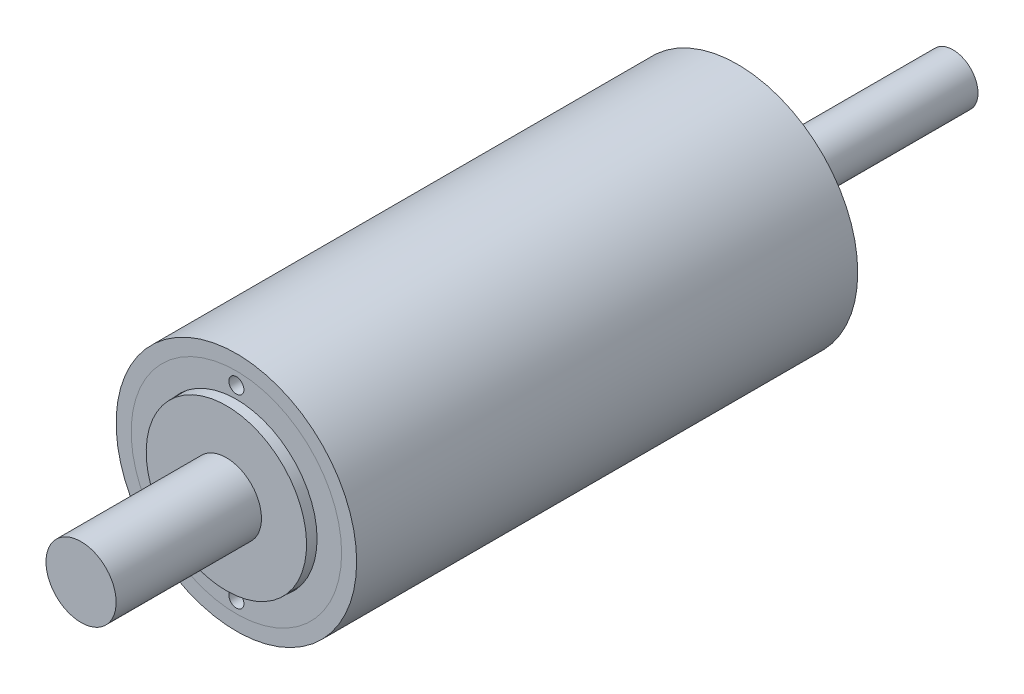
ISO-10303-21;
HEADER;
FILE_DESCRIPTION(('STEP AP214'),'2;1');
FILE_NAME('part.step','',(''),(''),'','','');
FILE_SCHEMA(('AUTOMOTIVE_DESIGN { 1 0 10303 214 1 1 1 1 }'));
ENDSEC;
DATA;
#1=APPLICATION_CONTEXT('core data for automotive mechanical design processes');
#2=APPLICATION_PROTOCOL_DEFINITION('international standard','automotive_design',2000,#1);
#3=PRODUCT_CONTEXT('',#1,'mechanical');
#4=PRODUCT('Part','Part','',(#3));
#5=PRODUCT_RELATED_PRODUCT_CATEGORY('part','',(#4));
#6=PRODUCT_DEFINITION_FORMATION('','',#4);
#7=PRODUCT_DEFINITION_CONTEXT('part definition',#1,'design');
#8=PRODUCT_DEFINITION('design','',#6,#7);
#9=PRODUCT_DEFINITION_SHAPE('','',#8);
#10=(LENGTH_UNIT() NAMED_UNIT(*) SI_UNIT(.MILLI.,.METRE.));
#11=(NAMED_UNIT(*) PLANE_ANGLE_UNIT() SI_UNIT($,.RADIAN.));
#12=(NAMED_UNIT(*) SI_UNIT($,.STERADIAN.) SOLID_ANGLE_UNIT());
#13=UNCERTAINTY_MEASURE_WITH_UNIT(LENGTH_MEASURE(1.E-05),#10,'distance_accuracy_value','');
#14=(GEOMETRIC_REPRESENTATION_CONTEXT(3) GLOBAL_UNCERTAINTY_ASSIGNED_CONTEXT((#13)) GLOBAL_UNIT_ASSIGNED_CONTEXT((#10,
#11,#12)) REPRESENTATION_CONTEXT('',''));
#15=CARTESIAN_POINT('',(0.,0.,0.));
#16=DIRECTION('',(0.,0.,1.));
#17=DIRECTION('',(1.,0.,0.));
#18=AXIS2_PLACEMENT_3D('',#15,#16,#17);
#19=CARTESIAN_POINT('',(0.,0.,-40.));
#20=DIRECTION('',(0.,0.,-1.));
#21=DIRECTION('',(-1.,0.,0.));
#22=AXIS2_PLACEMENT_3D('',#19,#20,#21);
#23=CYLINDRICAL_SURFACE('',#22,21.);
#24=CARTESIAN_POINT('',(0.,0.,-40.));
#25=DIRECTION('',(0.,0.,-1.));
#26=DIRECTION('',(-1.,0.,0.));
#27=AXIS2_PLACEMENT_3D('',#24,#25,#26);
#28=CIRCLE('',#27,21.);
#29=CARTESIAN_POINT('',(-21.,0.,-40.));
#30=VERTEX_POINT('',#29);
#31=EDGE_CURVE('E12',#30,#30,#28,.T.);
#32=ORIENTED_EDGE('',*,*,#31,.T.);
#33=EDGE_LOOP('',(#32));
#34=FACE_BOUND('',#33,.T.);
#35=CARTESIAN_POINT('',(0.,0.,-50.));
#36=DIRECTION('',(0.,0.,-1.));
#37=DIRECTION('',(-1.,0.,0.));
#38=AXIS2_PLACEMENT_3D('',#35,#36,#37);
#39=CIRCLE('',#38,21.);
#40=CARTESIAN_POINT('',(-21.,0.,-50.));
#41=VERTEX_POINT('',#40);
#42=EDGE_CURVE('E73',#41,#41,#39,.T.);
#43=ORIENTED_EDGE('',*,*,#42,.F.);
#44=EDGE_LOOP('',(#43));
#45=FACE_BOUND('',#44,.T.);
#46=ADVANCED_FACE('F70',(#34,#45),#23,.T.);
#47=CARTESIAN_POINT('',(0.,0.,-40.));
#48=DIRECTION('',(0.,0.,-1.));
#49=DIRECTION('',(-1.,0.,0.));
#50=AXIS2_PLACEMENT_3D('',#47,#48,#49);
#51=PLANE('',#50);
#52=CARTESIAN_POINT('',(0.,0.,-40.));
#53=DIRECTION('',(0.,0.,-1.));
#54=DIRECTION('',(-1.,0.,0.));
#55=AXIS2_PLACEMENT_3D('',#52,#53,#54);
#56=CIRCLE('',#55,13.5);
#57=CARTESIAN_POINT('',(-13.5,0.,-40.));
#58=VERTEX_POINT('',#57);
#59=EDGE_CURVE('E80',#58,#58,#56,.T.);
#60=ORIENTED_EDGE('',*,*,#59,.T.);
#61=EDGE_LOOP('',(#60));
#62=FACE_BOUND('',#61,.T.);
#63=ORIENTED_EDGE('',*,*,#31,.F.);
#64=EDGE_LOOP('',(#63));
#65=FACE_BOUND('',#64,.T.);
#66=ADVANCED_FACE('F113',(#62,#65),#51,.F.);
#67=CARTESIAN_POINT('',(0.,0.,-50.));
#68=DIRECTION('',(0.,0.,-1.));
#69=DIRECTION('',(-1.,0.,0.));
#70=AXIS2_PLACEMENT_3D('',#67,#68,#69);
#71=PLANE('',#70);
#72=CARTESIAN_POINT('',(0.,-18.5,-50.));
#73=DIRECTION('',(0.,0.,-1.));
#74=DIRECTION('',(-1.,0.,0.));
#75=AXIS2_PLACEMENT_3D('',#72,#73,#74);
#76=CIRCLE('',#75,1.5);
#77=CARTESIAN_POINT('',(-1.5,-18.5,-50.));
#78=VERTEX_POINT('',#77);
#79=EDGE_CURVE('E94',#78,#78,#76,.T.);
#80=ORIENTED_EDGE('',*,*,#79,.F.);
#81=EDGE_LOOP('',(#80));
#82=FACE_BOUND('',#81,.T.);
#83=CARTESIAN_POINT('',(0.,18.5,-50.));
#84=DIRECTION('',(0.,0.,-1.));
#85=DIRECTION('',(-1.,0.,0.));
#86=AXIS2_PLACEMENT_3D('',#83,#84,#85);
#87=CIRCLE('',#86,1.5);
#88=CARTESIAN_POINT('',(-1.5,18.5,-50.));
#89=VERTEX_POINT('',#88);
#90=EDGE_CURVE('E91',#89,#89,#87,.T.);
#91=ORIENTED_EDGE('',*,*,#90,.F.);
#92=EDGE_LOOP('',(#91));
#93=FACE_BOUND('',#92,.T.);
#94=CARTESIAN_POINT('',(0.,0.,-50.));
#95=DIRECTION('',(0.,0.,-1.));
#96=DIRECTION('',(-1.,0.,0.));
#97=AXIS2_PLACEMENT_3D('',#94,#95,#96);
#98=CIRCLE('',#97,13.5);
#99=CARTESIAN_POINT('',(-13.5,0.,-50.));
#100=VERTEX_POINT('',#99);
#101=EDGE_CURVE('E82',#100,#100,#98,.T.);
#102=ORIENTED_EDGE('',*,*,#101,.F.);
#103=EDGE_LOOP('',(#102));
#104=FACE_BOUND('',#103,.T.);
#105=ORIENTED_EDGE('',*,*,#42,.T.);
#106=EDGE_LOOP('',(#105));
#107=FACE_BOUND('',#106,.T.);
#108=ADVANCED_FACE('F109',(#82,#93,#104,#107),#71,.T.);
#109=CARTESIAN_POINT('',(0.,0.,-40.));
#110=DIRECTION('',(0.,0.,-1.));
#111=DIRECTION('',(-1.,0.,0.));
#112=AXIS2_PLACEMENT_3D('',#109,#110,#111);
#113=CYLINDRICAL_SURFACE('',#112,13.5);
#114=ORIENTED_EDGE('',*,*,#59,.F.);
#115=EDGE_LOOP('',(#114));
#116=FACE_BOUND('',#115,.T.);
#117=ORIENTED_EDGE('',*,*,#101,.T.);
#118=EDGE_LOOP('',(#117));
#119=FACE_BOUND('',#118,.T.);
#120=ADVANCED_FACE('F112',(#116,#119),#113,.F.);
#121=CARTESIAN_POINT('',(0.,18.5,-45.));
#122=DIRECTION('',(0.,0.,-1.));
#123=DIRECTION('',(-1.,0.,0.));
#124=AXIS2_PLACEMENT_3D('',#121,#122,#123);
#125=CYLINDRICAL_SURFACE('',#124,1.5);
#126=CARTESIAN_POINT('',(0.,18.5,-45.));
#127=DIRECTION('',(0.,0.,-1.));
#128=DIRECTION('',(-1.,0.,0.));
#129=AXIS2_PLACEMENT_3D('',#126,#127,#128);
#130=CIRCLE('',#129,1.5);
#131=CARTESIAN_POINT('',(-1.5,18.5,-45.));
#132=VERTEX_POINT('',#131);
#133=EDGE_CURVE('E88',#132,#132,#130,.T.);
#134=ORIENTED_EDGE('',*,*,#133,.F.);
#135=EDGE_LOOP('',(#134));
#136=FACE_BOUND('',#135,.T.);
#137=ORIENTED_EDGE('',*,*,#90,.T.);
#138=EDGE_LOOP('',(#137));
#139=FACE_BOUND('',#138,.T.);
#140=ADVANCED_FACE('F132',(#136,#139),#125,.F.);
#141=CARTESIAN_POINT('',(0.,18.5,-45.));
#142=DIRECTION('',(0.,0.,-1.));
#143=DIRECTION('',(-1.,0.,0.));
#144=AXIS2_PLACEMENT_3D('',#141,#142,#143);
#145=PLANE('',#144);
#146=ORIENTED_EDGE('',*,*,#133,.T.);
#147=EDGE_LOOP('',(#146));
#148=FACE_BOUND('',#147,.T.);
#149=ADVANCED_FACE('F105',(#148),#145,.T.);
#150=CARTESIAN_POINT('',(0.,-18.5,-45.));
#151=DIRECTION('',(0.,0.,-1.));
#152=DIRECTION('',(-1.,0.,0.));
#153=AXIS2_PLACEMENT_3D('',#150,#151,#152);
#154=CYLINDRICAL_SURFACE('',#153,1.5);
#155=CARTESIAN_POINT('',(0.,-18.5,-45.));
#156=DIRECTION('',(0.,0.,-1.));
#157=DIRECTION('',(-1.,0.,0.));
#158=AXIS2_PLACEMENT_3D('',#155,#156,#157);
#159=CIRCLE('',#158,1.5);
#160=CARTESIAN_POINT('',(-1.5,-18.5,-45.));
#161=VERTEX_POINT('',#160);
#162=EDGE_CURVE('E85',#161,#161,#159,.T.);
#163=ORIENTED_EDGE('',*,*,#162,.F.);
#164=EDGE_LOOP('',(#163));
#165=FACE_BOUND('',#164,.T.);
#166=ORIENTED_EDGE('',*,*,#79,.T.);
#167=EDGE_LOOP('',(#166));
#168=FACE_BOUND('',#167,.T.);
#169=ADVANCED_FACE('F102',(#165,#168),#154,.F.);
#170=CARTESIAN_POINT('',(0.,-18.5,-45.));
#171=DIRECTION('',(0.,0.,-1.));
#172=DIRECTION('',(-1.,0.,0.));
#173=AXIS2_PLACEMENT_3D('',#170,#171,#172);
#174=PLANE('',#173);
#175=ORIENTED_EDGE('',*,*,#162,.T.);
#176=EDGE_LOOP('',(#175));
#177=FACE_BOUND('',#176,.T.);
#178=ADVANCED_FACE('F100',(#177),#174,.T.);
#179=CLOSED_SHELL('',(#46,#66,#108,#120,#140,#149,#169,#178));
#180=MANIFOLD_SOLID_BREP('B2',#179);
#181=CARTESIAN_POINT('',(0.,0.,40.));
#182=DIRECTION('',(0.,0.,1.));
#183=DIRECTION('',(1.,0.,0.));
#184=AXIS2_PLACEMENT_3D('',#181,#182,#183);
#185=CYLINDRICAL_SURFACE('',#184,21.);
#186=CARTESIAN_POINT('',(0.,0.,40.));
#187=DIRECTION('',(0.,0.,1.));
#188=DIRECTION('',(1.,0.,0.));
#189=AXIS2_PLACEMENT_3D('',#186,#187,#188);
#190=CIRCLE('',#189,21.);
#191=CARTESIAN_POINT('',(21.,0.,40.));
#192=VERTEX_POINT('',#191);
#193=EDGE_CURVE('E69',#192,#192,#190,.T.);
#194=ORIENTED_EDGE('',*,*,#193,.T.);
#195=EDGE_LOOP('',(#194));
#196=FACE_BOUND('',#195,.T.);
#197=CARTESIAN_POINT('',(0.,0.,50.));
#198=DIRECTION('',(0.,0.,1.));
#199=DIRECTION('',(1.,0.,0.));
#200=AXIS2_PLACEMENT_3D('',#197,#198,#199);
#201=CIRCLE('',#200,21.);
#202=CARTESIAN_POINT('',(21.,0.,50.));
#203=VERTEX_POINT('',#202);
#204=EDGE_CURVE('E203',#203,#203,#201,.T.);
#205=ORIENTED_EDGE('',*,*,#204,.F.);
#206=EDGE_LOOP('',(#205));
#207=FACE_BOUND('',#206,.T.);
#208=ADVANCED_FACE('F200',(#196,#207),#185,.T.);
#209=CARTESIAN_POINT('',(0.,0.,40.));
#210=DIRECTION('',(0.,0.,1.));
#211=DIRECTION('',(1.,0.,0.));
#212=AXIS2_PLACEMENT_3D('',#209,#210,#211);
#213=PLANE('',#212);
#214=CARTESIAN_POINT('',(0.,0.,40.));
#215=DIRECTION('',(0.,0.,1.));
#216=DIRECTION('',(1.,0.,0.));
#217=AXIS2_PLACEMENT_3D('',#214,#215,#216);
#218=CIRCLE('',#217,16.1);
#219=CARTESIAN_POINT('',(16.1,0.,40.));
#220=VERTEX_POINT('',#219);
#221=EDGE_CURVE('E210',#220,#220,#218,.T.);
#222=ORIENTED_EDGE('',*,*,#221,.T.);
#223=EDGE_LOOP('',(#222));
#224=FACE_BOUND('',#223,.T.);
#225=ORIENTED_EDGE('',*,*,#193,.F.);
#226=EDGE_LOOP('',(#225));
#227=FACE_BOUND('',#226,.T.);
#228=ADVANCED_FACE('F243',(#224,#227),#213,.F.);
#229=CARTESIAN_POINT('',(0.,0.,50.));
#230=DIRECTION('',(0.,0.,1.));
#231=DIRECTION('',(1.,0.,0.));
#232=AXIS2_PLACEMENT_3D('',#229,#230,#231);
#233=PLANE('',#232);
#234=CARTESIAN_POINT('',(0.,-18.5,50.));
#235=DIRECTION('',(0.,0.,1.));
#236=DIRECTION('',(1.,0.,0.));
#237=AXIS2_PLACEMENT_3D('',#234,#235,#236);
#238=CIRCLE('',#237,1.5);
#239=CARTESIAN_POINT('',(1.5,-18.5,50.));
#240=VERTEX_POINT('',#239);
#241=EDGE_CURVE('E224',#240,#240,#238,.T.);
#242=ORIENTED_EDGE('',*,*,#241,.F.);
#243=EDGE_LOOP('',(#242));
#244=FACE_BOUND('',#243,.T.);
#245=CARTESIAN_POINT('',(0.,18.5,50.));
#246=DIRECTION('',(0.,0.,1.));
#247=DIRECTION('',(1.,0.,0.));
#248=AXIS2_PLACEMENT_3D('',#245,#246,#247);
#249=CIRCLE('',#248,1.5);
#250=CARTESIAN_POINT('',(1.5,18.5,50.));
#251=VERTEX_POINT('',#250);
#252=EDGE_CURVE('E218',#251,#251,#249,.T.);
#253=ORIENTED_EDGE('',*,*,#252,.F.);
#254=EDGE_LOOP('',(#253));
#255=FACE_BOUND('',#254,.T.);
#256=CARTESIAN_POINT('',(0.,0.,50.));
#257=DIRECTION('',(0.,0.,1.));
#258=DIRECTION('',(1.,0.,0.));
#259=AXIS2_PLACEMENT_3D('',#256,#257,#258);
#260=CIRCLE('',#259,16.1);
#261=CARTESIAN_POINT('',(16.1,0.,50.));
#262=VERTEX_POINT('',#261);
#263=EDGE_CURVE('E212',#262,#262,#260,.T.);
#264=ORIENTED_EDGE('',*,*,#263,.F.);
#265=EDGE_LOOP('',(#264));
#266=FACE_BOUND('',#265,.T.);
#267=ORIENTED_EDGE('',*,*,#204,.T.);
#268=EDGE_LOOP('',(#267));
#269=FACE_BOUND('',#268,.T.);
#270=ADVANCED_FACE('F239',(#244,#255,#266,#269),#233,.T.);
#271=CARTESIAN_POINT('',(0.,0.,40.));
#272=DIRECTION('',(0.,0.,1.));
#273=DIRECTION('',(1.,0.,0.));
#274=AXIS2_PLACEMENT_3D('',#271,#272,#273);
#275=CYLINDRICAL_SURFACE('',#274,16.1);
#276=ORIENTED_EDGE('',*,*,#221,.F.);
#277=EDGE_LOOP('',(#276));
#278=FACE_BOUND('',#277,.T.);
#279=ORIENTED_EDGE('',*,*,#263,.T.);
#280=EDGE_LOOP('',(#279));
#281=FACE_BOUND('',#280,.T.);
#282=ADVANCED_FACE('F242',(#278,#281),#275,.F.);
#283=CARTESIAN_POINT('',(0.,18.5,45.));
#284=DIRECTION('',(0.,0.,1.));
#285=DIRECTION('',(1.,0.,0.));
#286=AXIS2_PLACEMENT_3D('',#283,#284,#285);
#287=CYLINDRICAL_SURFACE('',#286,1.5);
#288=CARTESIAN_POINT('',(0.,18.5,45.));
#289=DIRECTION('',(0.,0.,1.));
#290=DIRECTION('',(1.,0.,0.));
#291=AXIS2_PLACEMENT_3D('',#288,#289,#290);
#292=CIRCLE('',#291,1.5);
#293=CARTESIAN_POINT('',(1.5,18.5,45.));
#294=VERTEX_POINT('',#293);
#295=EDGE_CURVE('E221',#294,#294,#292,.T.);
#296=ORIENTED_EDGE('',*,*,#295,.F.);
#297=EDGE_LOOP('',(#296));
#298=FACE_BOUND('',#297,.T.);
#299=ORIENTED_EDGE('',*,*,#252,.T.);
#300=EDGE_LOOP('',(#299));
#301=FACE_BOUND('',#300,.T.);
#302=ADVANCED_FACE('F262',(#298,#301),#287,.F.);
#303=CARTESIAN_POINT('',(0.,18.5,45.));
#304=DIRECTION('',(0.,0.,1.));
#305=DIRECTION('',(1.,0.,0.));
#306=AXIS2_PLACEMENT_3D('',#303,#304,#305);
#307=PLANE('',#306);
#308=ORIENTED_EDGE('',*,*,#295,.T.);
#309=EDGE_LOOP('',(#308));
#310=FACE_BOUND('',#309,.T.);
#311=ADVANCED_FACE('F235',(#310),#307,.T.);
#312=CARTESIAN_POINT('',(0.,-18.5,45.));
#313=DIRECTION('',(0.,0.,1.));
#314=DIRECTION('',(1.,0.,0.));
#315=AXIS2_PLACEMENT_3D('',#312,#313,#314);
#316=CYLINDRICAL_SURFACE('',#315,1.5);
#317=CARTESIAN_POINT('',(0.,-18.5,45.));
#318=DIRECTION('',(0.,0.,1.));
#319=DIRECTION('',(1.,0.,0.));
#320=AXIS2_PLACEMENT_3D('',#317,#318,#319);
#321=CIRCLE('',#320,1.5);
#322=CARTESIAN_POINT('',(1.5,-18.5,45.));
#323=VERTEX_POINT('',#322);
#324=EDGE_CURVE('E215',#323,#323,#321,.T.);
#325=ORIENTED_EDGE('',*,*,#324,.F.);
#326=EDGE_LOOP('',(#325));
#327=FACE_BOUND('',#326,.T.);
#328=ORIENTED_EDGE('',*,*,#241,.T.);
#329=EDGE_LOOP('',(#328));
#330=FACE_BOUND('',#329,.T.);
#331=ADVANCED_FACE('F232',(#327,#330),#316,.F.);
#332=CARTESIAN_POINT('',(0.,-18.5,45.));
#333=DIRECTION('',(0.,0.,1.));
#334=DIRECTION('',(1.,0.,0.));
#335=AXIS2_PLACEMENT_3D('',#332,#333,#334);
#336=PLANE('',#335);
#337=ORIENTED_EDGE('',*,*,#324,.T.);
#338=EDGE_LOOP('',(#337));
#339=FACE_BOUND('',#338,.T.);
#340=ADVANCED_FACE('F230',(#339),#336,.T.);
#341=CLOSED_SHELL('',(#208,#228,#270,#282,#302,#311,#331,#340));
#342=MANIFOLD_SOLID_BREP('B7',#341);
#343=CARTESIAN_POINT('',(0.,0.,16.));
#344=DIRECTION('',(0.,0.,1.));
#345=DIRECTION('',(1.,0.,0.));
#346=AXIS2_PLACEMENT_3D('',#343,#344,#345);
#347=CYLINDRICAL_SURFACE('',#346,20.);
#348=CARTESIAN_POINT('',(0.,0.,16.));
#349=DIRECTION('',(0.,0.,1.));
#350=DIRECTION('',(1.,0.,0.));
#351=AXIS2_PLACEMENT_3D('',#348,#349,#350);
#352=CIRCLE('',#351,20.);
#353=CARTESIAN_POINT('',(20.,0.,16.));
#354=VERTEX_POINT('',#353);
#355=EDGE_CURVE('E356',#354,#354,#352,.T.);
#356=ORIENTED_EDGE('',*,*,#355,.F.);
#357=EDGE_LOOP('',(#356));
#358=FACE_BOUND('',#357,.T.);
#359=CARTESIAN_POINT('',(0.,0.,40.));
#360=DIRECTION('',(0.,0.,1.));
#361=DIRECTION('',(1.,0.,0.));
#362=AXIS2_PLACEMENT_3D('',#359,#360,#361);
#363=CIRCLE('',#362,20.);
#364=CARTESIAN_POINT('',(20.,0.,40.));
#365=VERTEX_POINT('',#364);
#366=EDGE_CURVE('E377',#365,#365,#363,.T.);
#367=ORIENTED_EDGE('',*,*,#366,.T.);
#368=EDGE_LOOP('',(#367));
#369=FACE_BOUND('',#368,.T.);
#370=ADVANCED_FACE('F330',(#358,#369),#347,.F.);
#371=CARTESIAN_POINT('',(0.,0.,81.001));
#372=DIRECTION('',(0.,0.,-1.));
#373=DIRECTION('',(-1.,0.,0.));
#374=AXIS2_PLACEMENT_3D('',#371,#372,#373);
#375=CYLINDRICAL_SURFACE('',#374,16.);
#376=CARTESIAN_POINT('',(0.,0.,-39.));
#377=DIRECTION('',(0.,0.,-1.));
#378=DIRECTION('',(-1.,0.,0.));
#379=AXIS2_PLACEMENT_3D('',#376,#377,#378);
#380=CIRCLE('',#379,16.);
#381=CARTESIAN_POINT('',(-16.,0.,-39.));
#382=VERTEX_POINT('',#381);
#383=EDGE_CURVE('E349',#382,#382,#380,.T.);
#384=ORIENTED_EDGE('',*,*,#383,.T.);
#385=EDGE_LOOP('',(#384));
#386=FACE_BOUND('',#385,.T.);
#387=CARTESIAN_POINT('',(0.,0.,2.));
#388=DIRECTION('',(0.,0.,1.));
#389=DIRECTION('',(1.,0.,0.));
#390=AXIS2_PLACEMENT_3D('',#387,#388,#389);
#391=CIRCLE('',#390,16.);
#392=CARTESIAN_POINT('',(16.,0.,2.));
#393=VERTEX_POINT('',#392);
#394=EDGE_CURVE('E365',#393,#393,#391,.T.);
#395=ORIENTED_EDGE('',*,*,#394,.T.);
#396=EDGE_LOOP('',(#395));
#397=FACE_BOUND('',#396,.T.);
#398=ADVANCED_FACE('F409',(#386,#397),#375,.F.);
#399=CARTESIAN_POINT('',(0.,0.,50.));
#400=DIRECTION('',(0.,0.,-1.));
#401=DIRECTION('',(-1.,0.,0.));
#402=AXIS2_PLACEMENT_3D('',#399,#400,#401);
#403=CYLINDRICAL_SURFACE('',#402,24.);
#404=CARTESIAN_POINT('',(0.,0.,50.));
#405=DIRECTION('',(0.,0.,1.));
#406=DIRECTION('',(1.,0.,0.));
#407=AXIS2_PLACEMENT_3D('',#404,#405,#406);
#408=CIRCLE('',#407,24.);
#409=CARTESIAN_POINT('',(24.,0.,50.));
#410=VERTEX_POINT('',#409);
#411=EDGE_CURVE('E199',#410,#410,#408,.T.);
#412=ORIENTED_EDGE('',*,*,#411,.F.);
#413=EDGE_LOOP('',(#412));
#414=FACE_BOUND('',#413,.T.);
#415=CARTESIAN_POINT('',(0.,0.,-50.));
#416=DIRECTION('',(0.,0.,1.));
#417=DIRECTION('',(1.,0.,0.));
#418=AXIS2_PLACEMENT_3D('',#415,#416,#417);
#419=CIRCLE('',#418,24.);
#420=CARTESIAN_POINT('',(24.,0.,-50.));
#421=VERTEX_POINT('',#420);
#422=EDGE_CURVE('E334',#421,#421,#419,.T.);
#423=ORIENTED_EDGE('',*,*,#422,.T.);
#424=EDGE_LOOP('',(#423));
#425=FACE_BOUND('',#424,.T.);
#426=ADVANCED_FACE('F332',(#414,#425),#403,.T.);
#427=CARTESIAN_POINT('',(0.,0.,50.));
#428=DIRECTION('',(0.,0.,1.));
#429=DIRECTION('',(1.,0.,0.));
#430=AXIS2_PLACEMENT_3D('',#427,#428,#429);
#431=PLANE('',#430);
#432=CARTESIAN_POINT('',(0.,0.,50.));
#433=DIRECTION('',(0.,0.,1.));
#434=DIRECTION('',(1.,0.,0.));
#435=AXIS2_PLACEMENT_3D('',#432,#433,#434);
#436=CIRCLE('',#435,21.);
#437=CARTESIAN_POINT('',(21.,0.,50.));
#438=VERTEX_POINT('',#437);
#439=EDGE_CURVE('E373',#438,#438,#436,.T.);
#440=ORIENTED_EDGE('',*,*,#439,.F.);
#441=EDGE_LOOP('',(#440));
#442=FACE_BOUND('',#441,.T.);
#443=ORIENTED_EDGE('',*,*,#411,.T.);
#444=EDGE_LOOP('',(#443));
#445=FACE_BOUND('',#444,.T.);
#446=ADVANCED_FACE('F399',(#442,#445),#431,.T.);
#447=CARTESIAN_POINT('',(0.,0.,-50.));
#448=DIRECTION('',(0.,0.,1.));
#449=DIRECTION('',(1.,0.,0.));
#450=AXIS2_PLACEMENT_3D('',#447,#448,#449);
#451=PLANE('',#450);
#452=CARTESIAN_POINT('',(0.,0.,-50.));
#453=DIRECTION('',(0.,0.,-1.));
#454=DIRECTION('',(-1.,0.,0.));
#455=AXIS2_PLACEMENT_3D('',#452,#453,#454);
#456=CIRCLE('',#455,21.);
#457=CARTESIAN_POINT('',(-21.,0.,-50.));
#458=VERTEX_POINT('',#457);
#459=EDGE_CURVE('E345',#458,#458,#456,.T.);
#460=ORIENTED_EDGE('',*,*,#459,.F.);
#461=EDGE_LOOP('',(#460));
#462=FACE_BOUND('',#461,.T.);
#463=ORIENTED_EDGE('',*,*,#422,.F.);
#464=EDGE_LOOP('',(#463));
#465=FACE_BOUND('',#464,.T.);
#466=ADVANCED_FACE('F401',(#462,#465),#451,.F.);
#467=CARTESIAN_POINT('',(0.,0.,-39.));
#468=DIRECTION('',(0.,0.,-1.));
#469=DIRECTION('',(-1.,0.,0.));
#470=AXIS2_PLACEMENT_3D('',#467,#468,#469);
#471=CYLINDRICAL_SURFACE('',#470,21.);
#472=CARTESIAN_POINT('',(0.,0.,-39.));
#473=DIRECTION('',(0.,0.,-1.));
#474=DIRECTION('',(-1.,0.,0.));
#475=AXIS2_PLACEMENT_3D('',#472,#473,#474);
#476=CIRCLE('',#475,21.);
#477=CARTESIAN_POINT('',(-21.,0.,-39.));
#478=VERTEX_POINT('',#477);
#479=EDGE_CURVE('E343',#478,#478,#476,.T.);
#480=ORIENTED_EDGE('',*,*,#479,.F.);
#481=EDGE_LOOP('',(#480));
#482=FACE_BOUND('',#481,.T.);
#483=ORIENTED_EDGE('',*,*,#459,.T.);
#484=EDGE_LOOP('',(#483));
#485=FACE_BOUND('',#484,.T.);
#486=ADVANCED_FACE('F407',(#482,#485),#471,.F.);
#487=CARTESIAN_POINT('',(0.,0.,-39.));
#488=DIRECTION('',(0.,0.,-1.));
#489=DIRECTION('',(-1.,0.,0.));
#490=AXIS2_PLACEMENT_3D('',#487,#488,#489);
#491=PLANE('',#490);
#492=ORIENTED_EDGE('',*,*,#383,.F.);
#493=EDGE_LOOP('',(#492));
#494=FACE_BOUND('',#493,.T.);
#495=ORIENTED_EDGE('',*,*,#479,.T.);
#496=EDGE_LOOP('',(#495));
#497=FACE_BOUND('',#496,.T.);
#498=ADVANCED_FACE('F424',(#494,#497),#491,.T.);
#499=CARTESIAN_POINT('',(0.,0.,16.));
#500=DIRECTION('',(0.,0.,1.));
#501=DIRECTION('',(1.,0.,0.));
#502=AXIS2_PLACEMENT_3D('',#499,#500,#501);
#503=PLANE('',#502);
#504=CARTESIAN_POINT('',(0.,0.,16.));
#505=DIRECTION('',(0.,0.,1.));
#506=DIRECTION('',(1.,0.,0.));
#507=AXIS2_PLACEMENT_3D('',#504,#505,#506);
#508=CIRCLE('',#507,18.);
#509=CARTESIAN_POINT('',(18.,0.,16.));
#510=VERTEX_POINT('',#509);
#511=EDGE_CURVE('E361',#510,#510,#508,.T.);
#512=ORIENTED_EDGE('',*,*,#511,.F.);
#513=EDGE_LOOP('',(#512));
#514=FACE_BOUND('',#513,.T.);
#515=ORIENTED_EDGE('',*,*,#355,.T.);
#516=EDGE_LOOP('',(#515));
#517=FACE_BOUND('',#516,.T.);
#518=ADVANCED_FACE('F422',(#514,#517),#503,.T.);
#519=CARTESIAN_POINT('',(0.,0.,2.));
#520=DIRECTION('',(0.,0.,1.));
#521=DIRECTION('',(1.,0.,0.));
#522=AXIS2_PLACEMENT_3D('',#519,#520,#521);
#523=CYLINDRICAL_SURFACE('',#522,18.);
#524=CARTESIAN_POINT('',(0.,0.,2.));
#525=DIRECTION('',(0.,0.,1.));
#526=DIRECTION('',(1.,0.,0.));
#527=AXIS2_PLACEMENT_3D('',#524,#525,#526);
#528=CIRCLE('',#527,18.);
#529=CARTESIAN_POINT('',(18.,0.,2.));
#530=VERTEX_POINT('',#529);
#531=EDGE_CURVE('E360',#530,#530,#528,.T.);
#532=ORIENTED_EDGE('',*,*,#531,.F.);
#533=EDGE_LOOP('',(#532));
#534=FACE_BOUND('',#533,.T.);
#535=ORIENTED_EDGE('',*,*,#511,.T.);
#536=EDGE_LOOP('',(#535));
#537=FACE_BOUND('',#536,.T.);
#538=ADVANCED_FACE('F452',(#534,#537),#523,.F.);
#539=CARTESIAN_POINT('',(0.,0.,2.));
#540=DIRECTION('',(0.,0.,1.));
#541=DIRECTION('',(1.,0.,0.));
#542=AXIS2_PLACEMENT_3D('',#539,#540,#541);
#543=PLANE('',#542);
#544=ORIENTED_EDGE('',*,*,#394,.F.);
#545=EDGE_LOOP('',(#544));
#546=FACE_BOUND('',#545,.T.);
#547=ORIENTED_EDGE('',*,*,#531,.T.);
#548=EDGE_LOOP('',(#547));
#549=FACE_BOUND('',#548,.T.);
#550=ADVANCED_FACE('F395',(#546,#549),#543,.T.);
#551=CARTESIAN_POINT('',(0.,0.,40.));
#552=DIRECTION('',(0.,0.,1.));
#553=DIRECTION('',(1.,0.,0.));
#554=AXIS2_PLACEMENT_3D('',#551,#552,#553);
#555=CYLINDRICAL_SURFACE('',#554,21.);
#556=CARTESIAN_POINT('',(0.,0.,40.));
#557=DIRECTION('',(0.,0.,1.));
#558=DIRECTION('',(1.,0.,0.));
#559=AXIS2_PLACEMENT_3D('',#556,#557,#558);
#560=CIRCLE('',#559,21.);
#561=CARTESIAN_POINT('',(21.,0.,40.));
#562=VERTEX_POINT('',#561);
#563=EDGE_CURVE('E372',#562,#562,#560,.T.);
#564=ORIENTED_EDGE('',*,*,#563,.F.);
#565=EDGE_LOOP('',(#564));
#566=FACE_BOUND('',#565,.T.);
#567=ORIENTED_EDGE('',*,*,#439,.T.);
#568=EDGE_LOOP('',(#567));
#569=FACE_BOUND('',#568,.T.);
#570=ADVANCED_FACE('F389',(#566,#569),#555,.F.);
#571=CARTESIAN_POINT('',(0.,0.,40.));
#572=DIRECTION('',(0.,0.,1.));
#573=DIRECTION('',(1.,0.,0.));
#574=AXIS2_PLACEMENT_3D('',#571,#572,#573);
#575=PLANE('',#574);
#576=ORIENTED_EDGE('',*,*,#366,.F.);
#577=EDGE_LOOP('',(#576));
#578=FACE_BOUND('',#577,.T.);
#579=ORIENTED_EDGE('',*,*,#563,.T.);
#580=EDGE_LOOP('',(#579));
#581=FACE_BOUND('',#580,.T.);
#582=ADVANCED_FACE('F386',(#578,#581),#575,.T.);
#583=CLOSED_SHELL('',(#370,#398,#426,#446,#466,#486,#498,#518,#538,#550,#570,#582));
#584=MANIFOLD_SOLID_BREP('B64',#583);
#585=CARTESIAN_POINT('',(0.,0.,-39.));
#586=DIRECTION('',(0.,0.,-1.));
#587=DIRECTION('',(0.,1.,0.));
#588=AXIS2_PLACEMENT_3D('',#585,#586,#587);
#589=PLANE('',#588);
#590=CARTESIAN_POINT('',(0.,0.,-39.));
#591=DIRECTION('',(0.,0.,-1.));
#592=DIRECTION('',(0.,1.,0.));
#593=AXIS2_PLACEMENT_3D('',#590,#591,#592);
#594=CIRCLE('',#593,9.);
#595=CARTESIAN_POINT('',(0.,9.00000000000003,-39.));
#596=VERTEX_POINT('',#595);
#597=EDGE_CURVE('E536',#596,#596,#594,.T.);
#598=ORIENTED_EDGE('',*,*,#597,.F.);
#599=EDGE_LOOP('',(#598));
#600=FACE_BOUND('',#599,.T.);
#601=CARTESIAN_POINT('',(0.,0.,-39.));
#602=DIRECTION('',(0.,0.,-1.));
#603=DIRECTION('',(0.,1.,0.));
#604=AXIS2_PLACEMENT_3D('',#601,#602,#603);
#605=CIRCLE('',#604,5.99999999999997);
#606=CARTESIAN_POINT('',(0.,6.,-39.));
#607=VERTEX_POINT('',#606);
#608=EDGE_CURVE('E543',#607,#607,#605,.T.);
#609=ORIENTED_EDGE('',*,*,#608,.T.);
#610=EDGE_LOOP('',(#609));
#611=FACE_BOUND('',#610,.T.);
#612=ADVANCED_FACE('F532',(#600,#611),#589,.F.);
#613=CARTESIAN_POINT('',(0.,0.,-41.));
#614=DIRECTION('',(0.,0.,1.));
#615=DIRECTION('',(0.,-1.,0.));
#616=AXIS2_PLACEMENT_3D('',#613,#614,#615);
#617=CYLINDRICAL_SURFACE('',#616,9.);
#618=CARTESIAN_POINT('',(0.,0.,-41.));
#619=DIRECTION('',(0.,0.,-1.));
#620=DIRECTION('',(0.,1.,0.));
#621=AXIS2_PLACEMENT_3D('',#618,#619,#620);
#622=CIRCLE('',#621,9.);
#623=CARTESIAN_POINT('',(0.,9.00000000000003,-41.));
#624=VERTEX_POINT('',#623);
#625=EDGE_CURVE('E329',#624,#624,#622,.T.);
#626=ORIENTED_EDGE('',*,*,#625,.F.);
#627=EDGE_LOOP('',(#626));
#628=FACE_BOUND('',#627,.T.);
#629=ORIENTED_EDGE('',*,*,#597,.T.);
#630=EDGE_LOOP('',(#629));
#631=FACE_BOUND('',#630,.T.);
#632=ADVANCED_FACE('F534',(#628,#631),#617,.T.);
#633=CARTESIAN_POINT('',(0.,0.,-41.));
#634=DIRECTION('',(0.,0.,1.));
#635=DIRECTION('',(0.,-1.,0.));
#636=AXIS2_PLACEMENT_3D('',#633,#634,#635);
#637=CYLINDRICAL_SURFACE('',#636,5.99999999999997);
#638=ORIENTED_EDGE('',*,*,#608,.F.);
#639=EDGE_LOOP('',(#638));
#640=FACE_BOUND('',#639,.T.);
#641=CARTESIAN_POINT('',(0.,0.,-49.));
#642=DIRECTION('',(0.,0.,-1.));
#643=DIRECTION('',(0.,1.,0.));
#644=AXIS2_PLACEMENT_3D('',#641,#642,#643);
#645=CIRCLE('',#644,5.99999999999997);
#646=CARTESIAN_POINT('',(0.,6.,-49.));
#647=VERTEX_POINT('',#646);
#648=EDGE_CURVE('E551',#647,#647,#645,.T.);
#649=ORIENTED_EDGE('',*,*,#648,.T.);
#650=EDGE_LOOP('',(#649));
#651=FACE_BOUND('',#650,.T.);
#652=ADVANCED_FACE('F557',(#640,#651),#637,.F.);
#653=CARTESIAN_POINT('',(0.,0.,-49.));
#654=DIRECTION('',(0.,0.,-1.));
#655=DIRECTION('',(0.,1.,0.));
#656=AXIS2_PLACEMENT_3D('',#653,#654,#655);
#657=PLANE('',#656);
#658=CARTESIAN_POINT('',(0.,0.,-49.));
#659=DIRECTION('',(0.,0.,-1.));
#660=DIRECTION('',(0.,1.,0.));
#661=AXIS2_PLACEMENT_3D('',#658,#659,#660);
#662=CIRCLE('',#661,13.);
#663=CARTESIAN_POINT('',(0.,13.,-49.));
#664=VERTEX_POINT('',#663);
#665=EDGE_CURVE('E547',#664,#664,#662,.T.);
#666=ORIENTED_EDGE('',*,*,#665,.T.);
#667=EDGE_LOOP('',(#666));
#668=FACE_BOUND('',#667,.T.);
#669=ORIENTED_EDGE('',*,*,#648,.F.);
#670=EDGE_LOOP('',(#669));
#671=FACE_BOUND('',#670,.T.);
#672=ADVANCED_FACE('F559',(#668,#671),#657,.T.);
#673=CARTESIAN_POINT('',(0.,0.,-41.));
#674=DIRECTION('',(0.,0.,-1.));
#675=DIRECTION('',(0.,1.,0.));
#676=AXIS2_PLACEMENT_3D('',#673,#674,#675);
#677=PLANE('',#676);
#678=ORIENTED_EDGE('',*,*,#625,.T.);
#679=EDGE_LOOP('',(#678));
#680=FACE_BOUND('',#679,.T.);
#681=CARTESIAN_POINT('',(0.,0.,-41.));
#682=DIRECTION('',(0.,0.,-1.));
#683=DIRECTION('',(0.,1.,0.));
#684=AXIS2_PLACEMENT_3D('',#681,#682,#683);
#685=CIRCLE('',#684,13.);
#686=CARTESIAN_POINT('',(0.,13.,-41.));
#687=VERTEX_POINT('',#686);
#688=EDGE_CURVE('E548',#687,#687,#685,.T.);
#689=ORIENTED_EDGE('',*,*,#688,.F.);
#690=EDGE_LOOP('',(#689));
#691=FACE_BOUND('',#690,.T.);
#692=ADVANCED_FACE('F561',(#680,#691),#677,.F.);
#693=CARTESIAN_POINT('',(0.,0.,-49.));
#694=DIRECTION('',(0.,0.,1.));
#695=DIRECTION('',(0.,-1.,0.));
#696=AXIS2_PLACEMENT_3D('',#693,#694,#695);
#697=CYLINDRICAL_SURFACE('',#696,13.);
#698=ORIENTED_EDGE('',*,*,#665,.F.);
#699=EDGE_LOOP('',(#698));
#700=FACE_BOUND('',#699,.T.);
#701=ORIENTED_EDGE('',*,*,#688,.T.);
#702=EDGE_LOOP('',(#701));
#703=FACE_BOUND('',#702,.T.);
#704=ADVANCED_FACE('F568',(#700,#703),#697,.T.);
#705=CLOSED_SHELL('',(#612,#632,#652,#672,#692,#704));
#706=MANIFOLD_SOLID_BREP('B194',#705);
#707=CARTESIAN_POINT('',(0.,0.,-39.));
#708=DIRECTION('',(0.,0.,-1.));
#709=DIRECTION('',(0.,1.,0.));
#710=AXIS2_PLACEMENT_3D('',#707,#708,#709);
#711=PLANE('',#710);
#712=CARTESIAN_POINT('',(0.,0.,-39.));
#713=DIRECTION('',(0.,0.,-1.));
#714=DIRECTION('',(0.,1.,0.));
#715=AXIS2_PLACEMENT_3D('',#712,#713,#714);
#716=CIRCLE('',#715,16.);
#717=CARTESIAN_POINT('',(0.,16.,-39.));
#718=VERTEX_POINT('',#717);
#719=EDGE_CURVE('E531',#718,#718,#716,.T.);
#720=ORIENTED_EDGE('',*,*,#719,.T.);
#721=EDGE_LOOP('',(#720));
#722=FACE_BOUND('',#721,.T.);
#723=CARTESIAN_POINT('',(0.,0.,-39.));
#724=DIRECTION('',(0.,0.,-1.));
#725=DIRECTION('',(0.,1.,0.));
#726=AXIS2_PLACEMENT_3D('',#723,#724,#725);
#727=CIRCLE('',#726,5.99999999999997);
#728=CARTESIAN_POINT('',(0.,6.,-39.));
#729=VERTEX_POINT('',#728);
#730=EDGE_CURVE('E646',#729,#729,#727,.T.);
#731=ORIENTED_EDGE('',*,*,#730,.F.);
#732=EDGE_LOOP('',(#731));
#733=FACE_BOUND('',#732,.T.);
#734=ADVANCED_FACE('F635',(#722,#733),#711,.T.);
#735=CARTESIAN_POINT('',(0.,0.,-29.));
#736=DIRECTION('',(0.,0.,-1.));
#737=DIRECTION('',(0.,1.,0.));
#738=AXIS2_PLACEMENT_3D('',#735,#736,#737);
#739=PLANE('',#738);
#740=CARTESIAN_POINT('',(0.,0.,-29.));
#741=DIRECTION('',(0.,0.,-1.));
#742=DIRECTION('',(0.,1.,0.));
#743=AXIS2_PLACEMENT_3D('',#740,#741,#742);
#744=CIRCLE('',#743,16.);
#745=CARTESIAN_POINT('',(0.,16.,-29.));
#746=VERTEX_POINT('',#745);
#747=EDGE_CURVE('E639',#746,#746,#744,.T.);
#748=ORIENTED_EDGE('',*,*,#747,.F.);
#749=EDGE_LOOP('',(#748));
#750=FACE_BOUND('',#749,.T.);
#751=CARTESIAN_POINT('',(0.,0.,-29.));
#752=DIRECTION('',(0.,0.,-1.));
#753=DIRECTION('',(0.,1.,0.));
#754=AXIS2_PLACEMENT_3D('',#751,#752,#753);
#755=CIRCLE('',#754,5.99999999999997);
#756=CARTESIAN_POINT('',(0.,6.,-29.));
#757=VERTEX_POINT('',#756);
#758=EDGE_CURVE('E648',#757,#757,#755,.T.);
#759=ORIENTED_EDGE('',*,*,#758,.T.);
#760=EDGE_LOOP('',(#759));
#761=FACE_BOUND('',#760,.T.);
#762=ADVANCED_FACE('F658',(#750,#761),#739,.F.);
#763=CARTESIAN_POINT('',(0.,0.,-39.));
#764=DIRECTION('',(0.,0.,1.));
#765=DIRECTION('',(0.,-1.,0.));
#766=AXIS2_PLACEMENT_3D('',#763,#764,#765);
#767=CYLINDRICAL_SURFACE('',#766,16.);
#768=ORIENTED_EDGE('',*,*,#719,.F.);
#769=EDGE_LOOP('',(#768));
#770=FACE_BOUND('',#769,.T.);
#771=ORIENTED_EDGE('',*,*,#747,.T.);
#772=EDGE_LOOP('',(#771));
#773=FACE_BOUND('',#772,.T.);
#774=ADVANCED_FACE('F637',(#770,#773),#767,.T.);
#775=CARTESIAN_POINT('',(0.,0.,-39.));
#776=DIRECTION('',(0.,0.,1.));
#777=DIRECTION('',(0.,-1.,0.));
#778=AXIS2_PLACEMENT_3D('',#775,#776,#777);
#779=CYLINDRICAL_SURFACE('',#778,5.99999999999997);
#780=ORIENTED_EDGE('',*,*,#730,.T.);
#781=EDGE_LOOP('',(#780));
#782=FACE_BOUND('',#781,.T.);
#783=ORIENTED_EDGE('',*,*,#758,.F.);
#784=EDGE_LOOP('',(#783));
#785=FACE_BOUND('',#784,.T.);
#786=ADVANCED_FACE('F654',(#782,#785),#779,.F.);
#787=CLOSED_SHELL('',(#734,#762,#774,#786));
#788=MANIFOLD_SOLID_BREP('B324',#787);
#789=CARTESIAN_POINT('',(0.,0.,-29.));
#790=DIRECTION('',(0.,0.,1.));
#791=DIRECTION('',(0.,-1.,0.));
#792=AXIS2_PLACEMENT_3D('',#789,#790,#791);
#793=CYLINDRICAL_SURFACE('',#792,14.);
#794=CARTESIAN_POINT('',(0.,0.,-29.));
#795=DIRECTION('',(0.,0.,-1.));
#796=DIRECTION('',(0.,1.,0.));
#797=AXIS2_PLACEMENT_3D('',#794,#795,#796);
#798=CIRCLE('',#797,14.);
#799=CARTESIAN_POINT('',(0.,14.,-29.));
#800=VERTEX_POINT('',#799);
#801=EDGE_CURVE('E712',#800,#800,#798,.T.);
#802=ORIENTED_EDGE('',*,*,#801,.T.);
#803=EDGE_LOOP('',(#802));
#804=FACE_BOUND('',#803,.T.);
#805=CARTESIAN_POINT('',(0.,0.,-19.));
#806=DIRECTION('',(0.,0.,-1.));
#807=DIRECTION('',(0.,1.,0.));
#808=AXIS2_PLACEMENT_3D('',#805,#806,#807);
#809=CIRCLE('',#808,14.);
#810=CARTESIAN_POINT('',(0.,14.,-19.));
#811=VERTEX_POINT('',#810);
#812=EDGE_CURVE('E718',#811,#811,#809,.T.);
#813=ORIENTED_EDGE('',*,*,#812,.F.);
#814=EDGE_LOOP('',(#813));
#815=FACE_BOUND('',#814,.T.);
#816=ADVANCED_FACE('F705',(#804,#815),#793,.F.);
#817=CARTESIAN_POINT('',(0.,0.,-19.));
#818=DIRECTION('',(0.,0.,-1.));
#819=DIRECTION('',(0.,1.,0.));
#820=AXIS2_PLACEMENT_3D('',#817,#818,#819);
#821=PLANE('',#820);
#822=ORIENTED_EDGE('',*,*,#812,.T.);
#823=EDGE_LOOP('',(#822));
#824=FACE_BOUND('',#823,.T.);
#825=CARTESIAN_POINT('',(0.,0.,-19.));
#826=DIRECTION('',(0.,0.,-1.));
#827=DIRECTION('',(0.,1.,0.));
#828=AXIS2_PLACEMENT_3D('',#825,#826,#827);
#829=CIRCLE('',#828,15.5);
#830=CARTESIAN_POINT('',(0.,15.5,-19.));
#831=VERTEX_POINT('',#830);
#832=EDGE_CURVE('E708',#831,#831,#829,.T.);
#833=ORIENTED_EDGE('',*,*,#832,.F.);
#834=EDGE_LOOP('',(#833));
#835=FACE_BOUND('',#834,.T.);
#836=ADVANCED_FACE('F727',(#824,#835),#821,.F.);
#837=CARTESIAN_POINT('',(0.,0.,-29.));
#838=DIRECTION('',(0.,0.,1.));
#839=DIRECTION('',(0.,-1.,0.));
#840=AXIS2_PLACEMENT_3D('',#837,#838,#839);
#841=CYLINDRICAL_SURFACE('',#840,15.5);
#842=CARTESIAN_POINT('',(0.,0.,-29.));
#843=DIRECTION('',(0.,0.,-1.));
#844=DIRECTION('',(0.,1.,0.));
#845=AXIS2_PLACEMENT_3D('',#842,#843,#844);
#846=CIRCLE('',#845,15.5);
#847=CARTESIAN_POINT('',(0.,15.5,-29.));
#848=VERTEX_POINT('',#847);
#849=EDGE_CURVE('E634',#848,#848,#846,.T.);
#850=ORIENTED_EDGE('',*,*,#849,.F.);
#851=EDGE_LOOP('',(#850));
#852=FACE_BOUND('',#851,.T.);
#853=ORIENTED_EDGE('',*,*,#832,.T.);
#854=EDGE_LOOP('',(#853));
#855=FACE_BOUND('',#854,.T.);
#856=ADVANCED_FACE('F725',(#852,#855),#841,.T.);
#857=CARTESIAN_POINT('',(0.,0.,-29.));
#858=DIRECTION('',(0.,0.,-1.));
#859=DIRECTION('',(0.,1.,0.));
#860=AXIS2_PLACEMENT_3D('',#857,#858,#859);
#861=PLANE('',#860);
#862=ORIENTED_EDGE('',*,*,#801,.F.);
#863=EDGE_LOOP('',(#862));
#864=FACE_BOUND('',#863,.T.);
#865=ORIENTED_EDGE('',*,*,#849,.T.);
#866=EDGE_LOOP('',(#865));
#867=FACE_BOUND('',#866,.T.);
#868=ADVANCED_FACE('F734',(#864,#867),#861,.T.);
#869=CLOSED_SHELL('',(#816,#836,#856,#868));
#870=MANIFOLD_SOLID_BREP('B526',#869);
#871=CARTESIAN_POINT('',(0.,0.,-19.));
#872=DIRECTION('',(0.,0.,-1.));
#873=DIRECTION('',(0.,1.,0.));
#874=AXIS2_PLACEMENT_3D('',#871,#872,#873);
#875=PLANE('',#874);
#876=CARTESIAN_POINT('',(0.,0.,-19.));
#877=DIRECTION('',(0.,0.,-1.));
#878=DIRECTION('',(0.,1.,0.));
#879=AXIS2_PLACEMENT_3D('',#876,#877,#878);
#880=CIRCLE('',#879,16.);
#881=CARTESIAN_POINT('',(0.,16.,-19.));
#882=VERTEX_POINT('',#881);
#883=EDGE_CURVE('E704',#882,#882,#880,.T.);
#884=ORIENTED_EDGE('',*,*,#883,.T.);
#885=EDGE_LOOP('',(#884));
#886=FACE_BOUND('',#885,.T.);
#887=CARTESIAN_POINT('',(0.,0.,-19.));
#888=DIRECTION('',(0.,0.,-1.));
#889=DIRECTION('',(0.,1.,0.));
#890=AXIS2_PLACEMENT_3D('',#887,#888,#889);
#891=CIRCLE('',#890,5.99999999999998);
#892=CARTESIAN_POINT('',(0.,6.,-19.));
#893=VERTEX_POINT('',#892);
#894=EDGE_CURVE('E798',#893,#893,#891,.T.);
#895=ORIENTED_EDGE('',*,*,#894,.F.);
#896=EDGE_LOOP('',(#895));
#897=FACE_BOUND('',#896,.T.);
#898=ADVANCED_FACE('F787',(#886,#897),#875,.T.);
#899=CARTESIAN_POINT('',(0.,0.,-9.00000000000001));
#900=DIRECTION('',(0.,0.,-1.));
#901=DIRECTION('',(0.,1.,0.));
#902=AXIS2_PLACEMENT_3D('',#899,#900,#901);
#903=PLANE('',#902);
#904=CARTESIAN_POINT('',(0.,0.,-9.00000000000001));
#905=DIRECTION('',(0.,0.,-1.));
#906=DIRECTION('',(0.,1.,0.));
#907=AXIS2_PLACEMENT_3D('',#904,#905,#906);
#908=CIRCLE('',#907,16.);
#909=CARTESIAN_POINT('',(0.,16.,-9.00000000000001));
#910=VERTEX_POINT('',#909);
#911=EDGE_CURVE('E791',#910,#910,#908,.T.);
#912=ORIENTED_EDGE('',*,*,#911,.F.);
#913=EDGE_LOOP('',(#912));
#914=FACE_BOUND('',#913,.T.);
#915=CARTESIAN_POINT('',(0.,0.,-9.00000000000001));
#916=DIRECTION('',(0.,0.,-1.));
#917=DIRECTION('',(0.,1.,0.));
#918=AXIS2_PLACEMENT_3D('',#915,#916,#917);
#919=CIRCLE('',#918,5.99999999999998);
#920=CARTESIAN_POINT('',(0.,6.,-9.00000000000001));
#921=VERTEX_POINT('',#920);
#922=EDGE_CURVE('E800',#921,#921,#919,.T.);
#923=ORIENTED_EDGE('',*,*,#922,.T.);
#924=EDGE_LOOP('',(#923));
#925=FACE_BOUND('',#924,.T.);
#926=ADVANCED_FACE('F810',(#914,#925),#903,.F.);
#927=CARTESIAN_POINT('',(0.,0.,-19.));
#928=DIRECTION('',(0.,0.,1.));
#929=DIRECTION('',(0.,-1.,0.));
#930=AXIS2_PLACEMENT_3D('',#927,#928,#929);
#931=CYLINDRICAL_SURFACE('',#930,16.);
#932=ORIENTED_EDGE('',*,*,#883,.F.);
#933=EDGE_LOOP('',(#932));
#934=FACE_BOUND('',#933,.T.);
#935=ORIENTED_EDGE('',*,*,#911,.T.);
#936=EDGE_LOOP('',(#935));
#937=FACE_BOUND('',#936,.T.);
#938=ADVANCED_FACE('F789',(#934,#937),#931,.T.);
#939=CARTESIAN_POINT('',(0.,0.,-19.));
#940=DIRECTION('',(0.,0.,1.));
#941=DIRECTION('',(0.,-1.,0.));
#942=AXIS2_PLACEMENT_3D('',#939,#940,#941);
#943=CYLINDRICAL_SURFACE('',#942,5.99999999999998);
#944=ORIENTED_EDGE('',*,*,#894,.T.);
#945=EDGE_LOOP('',(#944));
#946=FACE_BOUND('',#945,.T.);
#947=ORIENTED_EDGE('',*,*,#922,.F.);
#948=EDGE_LOOP('',(#947));
#949=FACE_BOUND('',#948,.T.);
#950=ADVANCED_FACE('F806',(#946,#949),#943,.F.);
#951=CLOSED_SHELL('',(#898,#926,#938,#950));
#952=MANIFOLD_SOLID_BREP('B629',#951);
#953=CARTESIAN_POINT('',(0.,0.,16.));
#954=DIRECTION('',(0.,0.,-1.));
#955=DIRECTION('',(0.,1.,0.));
#956=AXIS2_PLACEMENT_3D('',#953,#954,#955);
#957=PLANE('',#956);
#958=CARTESIAN_POINT('',(0.,0.,16.));
#959=DIRECTION('',(0.,0.,-1.));
#960=DIRECTION('',(0.,1.,0.));
#961=AXIS2_PLACEMENT_3D('',#958,#959,#960);
#962=CIRCLE('',#961,11.5);
#963=CARTESIAN_POINT('',(0.,11.5,16.));
#964=VERTEX_POINT('',#963);
#965=EDGE_CURVE('E861',#964,#964,#962,.T.);
#966=ORIENTED_EDGE('',*,*,#965,.F.);
#967=EDGE_LOOP('',(#966));
#968=FACE_BOUND('',#967,.T.);
#969=CARTESIAN_POINT('',(0.,0.,16.));
#970=DIRECTION('',(0.,0.,-1.));
#971=DIRECTION('',(0.,1.,0.));
#972=AXIS2_PLACEMENT_3D('',#969,#970,#971);
#973=CIRCLE('',#972,8.49999999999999);
#974=CARTESIAN_POINT('',(0.,8.50000000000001,16.));
#975=VERTEX_POINT('',#974);
#976=EDGE_CURVE('E868',#975,#975,#973,.T.);
#977=ORIENTED_EDGE('',*,*,#976,.T.);
#978=EDGE_LOOP('',(#977));
#979=FACE_BOUND('',#978,.T.);
#980=ADVANCED_FACE('F857',(#968,#979),#957,.F.);
#981=CARTESIAN_POINT('',(0.,0.,14.));
#982=DIRECTION('',(0.,0.,1.));
#983=DIRECTION('',(0.,-1.,0.));
#984=AXIS2_PLACEMENT_3D('',#981,#982,#983);
#985=CYLINDRICAL_SURFACE('',#984,11.5);
#986=CARTESIAN_POINT('',(0.,0.,14.));
#987=DIRECTION('',(0.,0.,-1.));
#988=DIRECTION('',(0.,1.,0.));
#989=AXIS2_PLACEMENT_3D('',#986,#987,#988);
#990=CIRCLE('',#989,11.5);
#991=CARTESIAN_POINT('',(0.,11.5,14.));
#992=VERTEX_POINT('',#991);
#993=EDGE_CURVE('E786',#992,#992,#990,.T.);
#994=ORIENTED_EDGE('',*,*,#993,.F.);
#995=EDGE_LOOP('',(#994));
#996=FACE_BOUND('',#995,.T.);
#997=ORIENTED_EDGE('',*,*,#965,.T.);
#998=EDGE_LOOP('',(#997));
#999=FACE_BOUND('',#998,.T.);
#1000=ADVANCED_FACE('F859',(#996,#999),#985,.T.);
#1001=CARTESIAN_POINT('',(0.,0.,14.));
#1002=DIRECTION('',(0.,0.,1.));
#1003=DIRECTION('',(0.,-1.,0.));
#1004=AXIS2_PLACEMENT_3D('',#1001,#1002,#1003);
#1005=CYLINDRICAL_SURFACE('',#1004,8.49999999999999);
#1006=ORIENTED_EDGE('',*,*,#976,.F.);
#1007=EDGE_LOOP('',(#1006));
#1008=FACE_BOUND('',#1007,.T.);
#1009=CARTESIAN_POINT('',(0.,0.,6.00000000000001));
#1010=DIRECTION('',(0.,0.,-1.));
#1011=DIRECTION('',(0.,1.,0.));
#1012=AXIS2_PLACEMENT_3D('',#1009,#1010,#1011);
#1013=CIRCLE('',#1012,8.49999999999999);
#1014=CARTESIAN_POINT('',(0.,8.50000000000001,6.00000000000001));
#1015=VERTEX_POINT('',#1014);
#1016=EDGE_CURVE('E876',#1015,#1015,#1013,.T.);
#1017=ORIENTED_EDGE('',*,*,#1016,.T.);
#1018=EDGE_LOOP('',(#1017));
#1019=FACE_BOUND('',#1018,.T.);
#1020=ADVANCED_FACE('F882',(#1008,#1019),#1005,.F.);
#1021=CARTESIAN_POINT('',(0.,0.,6.00000000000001));
#1022=DIRECTION('',(0.,0.,-1.));
#1023=DIRECTION('',(0.,1.,0.));
#1024=AXIS2_PLACEMENT_3D('',#1021,#1022,#1023);
#1025=PLANE('',#1024);
#1026=CARTESIAN_POINT('',(0.,0.,6.00000000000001));
#1027=DIRECTION('',(0.,0.,-1.));
#1028=DIRECTION('',(0.,1.,0.));
#1029=AXIS2_PLACEMENT_3D('',#1026,#1027,#1028);
#1030=CIRCLE('',#1029,17.5);
#1031=CARTESIAN_POINT('',(0.,17.5,6.00000000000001));
#1032=VERTEX_POINT('',#1031);
#1033=EDGE_CURVE('E872',#1032,#1032,#1030,.T.);
#1034=ORIENTED_EDGE('',*,*,#1033,.T.);
#1035=EDGE_LOOP('',(#1034));
#1036=FACE_BOUND('',#1035,.T.);
#1037=ORIENTED_EDGE('',*,*,#1016,.F.);
#1038=EDGE_LOOP('',(#1037));
#1039=FACE_BOUND('',#1038,.T.);
#1040=ADVANCED_FACE('F884',(#1036,#1039),#1025,.T.);
#1041=CARTESIAN_POINT('',(0.,0.,14.));
#1042=DIRECTION('',(0.,0.,-1.));
#1043=DIRECTION('',(0.,1.,0.));
#1044=AXIS2_PLACEMENT_3D('',#1041,#1042,#1043);
#1045=PLANE('',#1044);
#1046=ORIENTED_EDGE('',*,*,#993,.T.);
#1047=EDGE_LOOP('',(#1046));
#1048=FACE_BOUND('',#1047,.T.);
#1049=CARTESIAN_POINT('',(0.,0.,14.));
#1050=DIRECTION('',(0.,0.,-1.));
#1051=DIRECTION('',(0.,1.,0.));
#1052=AXIS2_PLACEMENT_3D('',#1049,#1050,#1051);
#1053=CIRCLE('',#1052,17.5);
#1054=CARTESIAN_POINT('',(0.,17.5,14.));
#1055=VERTEX_POINT('',#1054);
#1056=EDGE_CURVE('E873',#1055,#1055,#1053,.T.);
#1057=ORIENTED_EDGE('',*,*,#1056,.F.);
#1058=EDGE_LOOP('',(#1057));
#1059=FACE_BOUND('',#1058,.T.);
#1060=ADVANCED_FACE('F886',(#1048,#1059),#1045,.F.);
#1061=CARTESIAN_POINT('',(0.,0.,6.00000000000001));
#1062=DIRECTION('',(0.,0.,1.));
#1063=DIRECTION('',(0.,-1.,0.));
#1064=AXIS2_PLACEMENT_3D('',#1061,#1062,#1063);
#1065=CYLINDRICAL_SURFACE('',#1064,17.5);
#1066=ORIENTED_EDGE('',*,*,#1033,.F.);
#1067=EDGE_LOOP('',(#1066));
#1068=FACE_BOUND('',#1067,.T.);
#1069=ORIENTED_EDGE('',*,*,#1056,.T.);
#1070=EDGE_LOOP('',(#1069));
#1071=FACE_BOUND('',#1070,.T.);
#1072=ADVANCED_FACE('F893',(#1068,#1071),#1065,.T.);
#1073=CLOSED_SHELL('',(#980,#1000,#1020,#1040,#1060,#1072));
#1074=MANIFOLD_SOLID_BREP('B699',#1073);
#1075=CARTESIAN_POINT('',(0.,0.,16.));
#1076=DIRECTION('',(0.,0.,-1.));
#1077=DIRECTION('',(0.,1.,0.));
#1078=AXIS2_PLACEMENT_3D('',#1075,#1076,#1077);
#1079=PLANE('',#1078);
#1080=CARTESIAN_POINT('',(0.,0.,16.));
#1081=DIRECTION('',(0.,0.,-1.));
#1082=DIRECTION('',(0.,1.,0.));
#1083=AXIS2_PLACEMENT_3D('',#1080,#1081,#1082);
#1084=CIRCLE('',#1083,20.);
#1085=CARTESIAN_POINT('',(0.,20.,16.));
#1086=VERTEX_POINT('',#1085);
#1087=EDGE_CURVE('E856',#1086,#1086,#1084,.T.);
#1088=ORIENTED_EDGE('',*,*,#1087,.T.);
#1089=EDGE_LOOP('',(#1088));
#1090=FACE_BOUND('',#1089,.T.);
#1091=CARTESIAN_POINT('',(0.,0.,16.));
#1092=DIRECTION('',(0.,0.,-1.));
#1093=DIRECTION('',(0.,1.,0.));
#1094=AXIS2_PLACEMENT_3D('',#1091,#1092,#1093);
#1095=CIRCLE('',#1094,8.49999999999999);
#1096=CARTESIAN_POINT('',(0.,8.50000000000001,16.));
#1097=VERTEX_POINT('',#1096);
#1098=EDGE_CURVE('E971',#1097,#1097,#1095,.T.);
#1099=ORIENTED_EDGE('',*,*,#1098,.F.);
#1100=EDGE_LOOP('',(#1099));
#1101=FACE_BOUND('',#1100,.T.);
#1102=ADVANCED_FACE('F960',(#1090,#1101),#1079,.T.);
#1103=CARTESIAN_POINT('',(0.,0.,28.));
#1104=DIRECTION('',(0.,0.,-1.));
#1105=DIRECTION('',(0.,1.,0.));
#1106=AXIS2_PLACEMENT_3D('',#1103,#1104,#1105);
#1107=PLANE('',#1106);
#1108=CARTESIAN_POINT('',(0.,0.,28.));
#1109=DIRECTION('',(0.,0.,-1.));
#1110=DIRECTION('',(0.,1.,0.));
#1111=AXIS2_PLACEMENT_3D('',#1108,#1109,#1110);
#1112=CIRCLE('',#1111,20.);
#1113=CARTESIAN_POINT('',(0.,20.,28.));
#1114=VERTEX_POINT('',#1113);
#1115=EDGE_CURVE('E964',#1114,#1114,#1112,.T.);
#1116=ORIENTED_EDGE('',*,*,#1115,.F.);
#1117=EDGE_LOOP('',(#1116));
#1118=FACE_BOUND('',#1117,.T.);
#1119=CARTESIAN_POINT('',(0.,0.,28.));
#1120=DIRECTION('',(0.,0.,-1.));
#1121=DIRECTION('',(0.,1.,0.));
#1122=AXIS2_PLACEMENT_3D('',#1119,#1120,#1121);
#1123=CIRCLE('',#1122,8.49999999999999);
#1124=CARTESIAN_POINT('',(0.,8.5,28.));
#1125=VERTEX_POINT('',#1124);
#1126=EDGE_CURVE('E973',#1125,#1125,#1123,.T.);
#1127=ORIENTED_EDGE('',*,*,#1126,.T.);
#1128=EDGE_LOOP('',(#1127));
#1129=FACE_BOUND('',#1128,.T.);
#1130=ADVANCED_FACE('F983',(#1118,#1129),#1107,.F.);
#1131=CARTESIAN_POINT('',(0.,0.,16.));
#1132=DIRECTION('',(0.,0.,1.));
#1133=DIRECTION('',(0.,-1.,0.));
#1134=AXIS2_PLACEMENT_3D('',#1131,#1132,#1133);
#1135=CYLINDRICAL_SURFACE('',#1134,20.);
#1136=ORIENTED_EDGE('',*,*,#1087,.F.);
#1137=EDGE_LOOP('',(#1136));
#1138=FACE_BOUND('',#1137,.T.);
#1139=ORIENTED_EDGE('',*,*,#1115,.T.);
#1140=EDGE_LOOP('',(#1139));
#1141=FACE_BOUND('',#1140,.T.);
#1142=ADVANCED_FACE('F962',(#1138,#1141),#1135,.T.);
#1143=CARTESIAN_POINT('',(0.,0.,16.));
#1144=DIRECTION('',(0.,0.,1.));
#1145=DIRECTION('',(0.,-1.,0.));
#1146=AXIS2_PLACEMENT_3D('',#1143,#1144,#1145);
#1147=CYLINDRICAL_SURFACE('',#1146,8.49999999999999);
#1148=ORIENTED_EDGE('',*,*,#1098,.T.);
#1149=EDGE_LOOP('',(#1148));
#1150=FACE_BOUND('',#1149,.T.);
#1151=ORIENTED_EDGE('',*,*,#1126,.F.);
#1152=EDGE_LOOP('',(#1151));
#1153=FACE_BOUND('',#1152,.T.);
#1154=ADVANCED_FACE('F979',(#1150,#1153),#1147,.F.);
#1155=CLOSED_SHELL('',(#1102,#1130,#1142,#1154));
#1156=MANIFOLD_SOLID_BREP('B781',#1155);
#1157=CARTESIAN_POINT('',(0.,0.,28.));
#1158=DIRECTION('',(0.,0.,-1.));
#1159=DIRECTION('',(0.,1.,0.));
#1160=AXIS2_PLACEMENT_3D('',#1157,#1158,#1159);
#1161=PLANE('',#1160);
#1162=CARTESIAN_POINT('',(0.,0.,28.));
#1163=DIRECTION('',(0.,0.,-1.));
#1164=DIRECTION('',(0.,1.,0.));
#1165=AXIS2_PLACEMENT_3D('',#1162,#1163,#1164);
#1166=CIRCLE('',#1165,20.);
#1167=CARTESIAN_POINT('',(0.,20.,28.));
#1168=VERTEX_POINT('',#1167);
#1169=EDGE_CURVE('E959',#1168,#1168,#1166,.T.);
#1170=ORIENTED_EDGE('',*,*,#1169,.T.);
#1171=EDGE_LOOP('',(#1170));
#1172=FACE_BOUND('',#1171,.T.);
#1173=CARTESIAN_POINT('',(0.,0.,28.));
#1174=DIRECTION('',(0.,0.,-1.));
#1175=DIRECTION('',(0.,1.,0.));
#1176=AXIS2_PLACEMENT_3D('',#1173,#1174,#1175);
#1177=CIRCLE('',#1176,8.49999999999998);
#1178=CARTESIAN_POINT('',(0.,8.5,28.));
#1179=VERTEX_POINT('',#1178);
#1180=EDGE_CURVE('E1040',#1179,#1179,#1177,.T.);
#1181=ORIENTED_EDGE('',*,*,#1180,.F.);
#1182=EDGE_LOOP('',(#1181));
#1183=FACE_BOUND('',#1182,.T.);
#1184=ADVANCED_FACE('F1029',(#1172,#1183),#1161,.T.);
#1185=CARTESIAN_POINT('',(0.,0.,40.));
#1186=DIRECTION('',(0.,0.,-1.));
#1187=DIRECTION('',(0.,1.,0.));
#1188=AXIS2_PLACEMENT_3D('',#1185,#1186,#1187);
#1189=PLANE('',#1188);
#1190=CARTESIAN_POINT('',(0.,0.,40.));
#1191=DIRECTION('',(0.,0.,-1.));
#1192=DIRECTION('',(0.,1.,0.));
#1193=AXIS2_PLACEMENT_3D('',#1190,#1191,#1192);
#1194=CIRCLE('',#1193,20.);
#1195=CARTESIAN_POINT('',(0.,20.,40.));
#1196=VERTEX_POINT('',#1195);
#1197=EDGE_CURVE('E1033',#1196,#1196,#1194,.T.);
#1198=ORIENTED_EDGE('',*,*,#1197,.F.);
#1199=EDGE_LOOP('',(#1198));
#1200=FACE_BOUND('',#1199,.T.);
#1201=CARTESIAN_POINT('',(0.,0.,40.));
#1202=DIRECTION('',(0.,0.,-1.));
#1203=DIRECTION('',(0.,1.,0.));
#1204=AXIS2_PLACEMENT_3D('',#1201,#1202,#1203);
#1205=CIRCLE('',#1204,8.49999999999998);
#1206=CARTESIAN_POINT('',(0.,8.5,40.));
#1207=VERTEX_POINT('',#1206);
#1208=EDGE_CURVE('E1042',#1207,#1207,#1205,.T.);
#1209=ORIENTED_EDGE('',*,*,#1208,.T.);
#1210=EDGE_LOOP('',(#1209));
#1211=FACE_BOUND('',#1210,.T.);
#1212=ADVANCED_FACE('F1052',(#1200,#1211),#1189,.F.);
#1213=CARTESIAN_POINT('',(0.,0.,28.));
#1214=DIRECTION('',(0.,0.,1.));
#1215=DIRECTION('',(0.,-1.,0.));
#1216=AXIS2_PLACEMENT_3D('',#1213,#1214,#1215);
#1217=CYLINDRICAL_SURFACE('',#1216,20.);
#1218=ORIENTED_EDGE('',*,*,#1169,.F.);
#1219=EDGE_LOOP('',(#1218));
#1220=FACE_BOUND('',#1219,.T.);
#1221=ORIENTED_EDGE('',*,*,#1197,.T.);
#1222=EDGE_LOOP('',(#1221));
#1223=FACE_BOUND('',#1222,.T.);
#1224=ADVANCED_FACE('F1031',(#1220,#1223),#1217,.T.);
#1225=CARTESIAN_POINT('',(0.,0.,28.));
#1226=DIRECTION('',(0.,0.,1.));
#1227=DIRECTION('',(0.,-1.,0.));
#1228=AXIS2_PLACEMENT_3D('',#1225,#1226,#1227);
#1229=CYLINDRICAL_SURFACE('',#1228,8.49999999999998);
#1230=ORIENTED_EDGE('',*,*,#1180,.T.);
#1231=EDGE_LOOP('',(#1230));
#1232=FACE_BOUND('',#1231,.T.);
#1233=ORIENTED_EDGE('',*,*,#1208,.F.);
#1234=EDGE_LOOP('',(#1233));
#1235=FACE_BOUND('',#1234,.T.);
#1236=ADVANCED_FACE('F1048',(#1232,#1235),#1229,.F.);
#1237=CLOSED_SHELL('',(#1184,#1212,#1224,#1236));
#1238=MANIFOLD_SOLID_BREP('B851',#1237);
#1239=CARTESIAN_POINT('',(0.,0.,81.));
#1240=DIRECTION('',(0.,0.,-1.));
#1241=DIRECTION('',(0.,1.,0.));
#1242=AXIS2_PLACEMENT_3D('',#1239,#1240,#1241);
#1243=PLANE('',#1242);
#1244=CARTESIAN_POINT('',(0.,0.,81.));
#1245=DIRECTION('',(0.,0.,1.));
#1246=DIRECTION('',(0.,-1.,0.));
#1247=AXIS2_PLACEMENT_3D('',#1244,#1245,#1246);
#1248=CIRCLE('',#1247,6.99999999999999);
#1249=CARTESIAN_POINT('',(0.,-6.99999999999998,81.));
#1250=VERTEX_POINT('',#1249);
#1251=EDGE_CURVE('E1028',#1250,#1250,#1248,.T.);
#1252=ORIENTED_EDGE('',*,*,#1251,.T.);
#1253=EDGE_LOOP('',(#1252));
#1254=FACE_BOUND('',#1253,.T.);
#1255=ADVANCED_FACE('F1091',(#1254),#1243,.F.);
#1256=CARTESIAN_POINT('',(0.,0.,126.394277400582));
#1257=DIRECTION('',(0.,0.,1.));
#1258=DIRECTION('',(0.,-1.,0.));
#1259=AXIS2_PLACEMENT_3D('',#1256,#1257,#1258);
#1260=CYLINDRICAL_SURFACE('',#1259,6.99999999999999);
#1261=ORIENTED_EDGE('',*,*,#1251,.F.);
#1262=EDGE_LOOP('',(#1261));
#1263=FACE_BOUND('',#1262,.T.);
#1264=CARTESIAN_POINT('',(0.,0.,52.));
#1265=DIRECTION('',(0.,0.,1.));
#1266=DIRECTION('',(0.,-1.,0.));
#1267=AXIS2_PLACEMENT_3D('',#1264,#1265,#1266);
#1268=CIRCLE('',#1267,6.99999999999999);
#1269=CARTESIAN_POINT('',(0.,-6.99999999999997,52.));
#1270=VERTEX_POINT('',#1269);
#1271=EDGE_CURVE('E1097',#1270,#1270,#1268,.T.);
#1272=ORIENTED_EDGE('',*,*,#1271,.T.);
#1273=EDGE_LOOP('',(#1272));
#1274=FACE_BOUND('',#1273,.T.);
#1275=ADVANCED_FACE('F1183',(#1263,#1274),#1260,.T.);
#1276=CARTESIAN_POINT('',(0.,7.,52.));
#1277=DIRECTION('',(0.,0.,-1.));
#1278=DIRECTION('',(0.,1.,0.));
#1279=AXIS2_PLACEMENT_3D('',#1276,#1277,#1278);
#1280=PLANE('',#1279);
#1281=ORIENTED_EDGE('',*,*,#1271,.F.);
#1282=EDGE_LOOP('',(#1281));
#1283=FACE_BOUND('',#1282,.T.);
#1284=CARTESIAN_POINT('',(0.,0.,52.));
#1285=DIRECTION('',(0.,0.,1.));
#1286=DIRECTION('',(0.,-1.,0.));
#1287=AXIS2_PLACEMENT_3D('',#1284,#1285,#1286);
#1288=CIRCLE('',#1287,16.);
#1289=CARTESIAN_POINT('',(0.,-16.,52.));
#1290=VERTEX_POINT('',#1289);
#1291=EDGE_CURVE('E1101',#1290,#1290,#1288,.T.);
#1292=ORIENTED_EDGE('',*,*,#1291,.T.);
#1293=EDGE_LOOP('',(#1292));
#1294=FACE_BOUND('',#1293,.T.);
#1295=ADVANCED_FACE('F1187',(#1283,#1294),#1280,.F.);
#1296=CARTESIAN_POINT('',(0.,0.,126.394277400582));
#1297=DIRECTION('',(0.,0.,1.));
#1298=DIRECTION('',(0.,-1.,0.));
#1299=AXIS2_PLACEMENT_3D('',#1296,#1297,#1298);
#1300=CYLINDRICAL_SURFACE('',#1299,16.);
#1301=ORIENTED_EDGE('',*,*,#1291,.F.);
#1302=EDGE_LOOP('',(#1301));
#1303=FACE_BOUND('',#1302,.T.);
#1304=CARTESIAN_POINT('',(0.,0.,48.));
#1305=DIRECTION('',(0.,0.,1.));
#1306=DIRECTION('',(0.,-1.,0.));
#1307=AXIS2_PLACEMENT_3D('',#1304,#1305,#1306);
#1308=CIRCLE('',#1307,16.);
#1309=CARTESIAN_POINT('',(0.,-16.,48.));
#1310=VERTEX_POINT('',#1309);
#1311=EDGE_CURVE('E1105',#1310,#1310,#1308,.T.);
#1312=ORIENTED_EDGE('',*,*,#1311,.T.);
#1313=EDGE_LOOP('',(#1312));
#1314=FACE_BOUND('',#1313,.T.);
#1315=ADVANCED_FACE('F1192',(#1303,#1314),#1300,.T.);
#1316=CARTESIAN_POINT('',(0.,16.,48.));
#1317=DIRECTION('',(0.,0.,1.));
#1318=DIRECTION('',(0.,-1.,0.));
#1319=AXIS2_PLACEMENT_3D('',#1316,#1317,#1318);
#1320=PLANE('',#1319);
#1321=ORIENTED_EDGE('',*,*,#1311,.F.);
#1322=EDGE_LOOP('',(#1321));
#1323=FACE_BOUND('',#1322,.T.);
#1324=CARTESIAN_POINT('',(0.,0.,48.));
#1325=DIRECTION('',(0.,0.,1.));
#1326=DIRECTION('',(0.,-1.,0.));
#1327=AXIS2_PLACEMENT_3D('',#1324,#1325,#1326);
#1328=CIRCLE('',#1327,7.39999999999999);
#1329=CARTESIAN_POINT('',(0.,-7.39999999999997,48.));
#1330=VERTEX_POINT('',#1329);
#1331=EDGE_CURVE('E1110',#1330,#1330,#1328,.T.);
#1332=ORIENTED_EDGE('',*,*,#1331,.T.);
#1333=EDGE_LOOP('',(#1332));
#1334=FACE_BOUND('',#1333,.T.);
#1335=ADVANCED_FACE('F1198',(#1323,#1334),#1320,.F.);
#1336=CARTESIAN_POINT('',(0.,0.,126.394277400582));
#1337=DIRECTION('',(0.,0.,1.));
#1338=DIRECTION('',(0.,-1.,0.));
#1339=AXIS2_PLACEMENT_3D('',#1336,#1337,#1338);
#1340=CYLINDRICAL_SURFACE('',#1339,7.39999999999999);
#1341=ORIENTED_EDGE('',*,*,#1331,.F.);
#1342=EDGE_LOOP('',(#1341));
#1343=FACE_BOUND('',#1342,.T.);
#1344=CARTESIAN_POINT('',(0.,0.,44.));
#1345=DIRECTION('',(0.,0.,1.));
#1346=DIRECTION('',(0.,-1.,0.));
#1347=AXIS2_PLACEMENT_3D('',#1344,#1345,#1346);
#1348=CIRCLE('',#1347,7.39999999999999);
#1349=CARTESIAN_POINT('',(0.,-7.39999999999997,44.));
#1350=VERTEX_POINT('',#1349);
#1351=EDGE_CURVE('E1113',#1350,#1350,#1348,.T.);
#1352=ORIENTED_EDGE('',*,*,#1351,.T.);
#1353=EDGE_LOOP('',(#1352));
#1354=FACE_BOUND('',#1353,.T.);
#1355=ADVANCED_FACE('F1202',(#1343,#1354),#1340,.T.);
#1356=CARTESIAN_POINT('',(0.,7.4,44.));
#1357=DIRECTION('',(0.,0.,-1.));
#1358=DIRECTION('',(0.,1.,0.));
#1359=AXIS2_PLACEMENT_3D('',#1356,#1357,#1358);
#1360=PLANE('',#1359);
#1361=ORIENTED_EDGE('',*,*,#1351,.F.);
#1362=EDGE_LOOP('',(#1361));
#1363=FACE_BOUND('',#1362,.T.);
#1364=CARTESIAN_POINT('',(0.,0.,44.));
#1365=DIRECTION('',(0.,0.,1.));
#1366=DIRECTION('',(0.,-1.,0.));
#1367=AXIS2_PLACEMENT_3D('',#1364,#1365,#1366);
#1368=CIRCLE('',#1367,11.);
#1369=CARTESIAN_POINT('',(0.,-11.,44.));
#1370=VERTEX_POINT('',#1369);
#1371=EDGE_CURVE('E1116',#1370,#1370,#1368,.T.);
#1372=ORIENTED_EDGE('',*,*,#1371,.T.);
#1373=EDGE_LOOP('',(#1372));
#1374=FACE_BOUND('',#1373,.T.);
#1375=ADVANCED_FACE('F1206',(#1363,#1374),#1360,.F.);
#1376=CARTESIAN_POINT('',(0.,0.,126.394277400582));
#1377=DIRECTION('',(0.,0.,1.));
#1378=DIRECTION('',(0.,-1.,0.));
#1379=AXIS2_PLACEMENT_3D('',#1376,#1377,#1378);
#1380=CYLINDRICAL_SURFACE('',#1379,11.);
#1381=ORIENTED_EDGE('',*,*,#1371,.F.);
#1382=EDGE_LOOP('',(#1381));
#1383=FACE_BOUND('',#1382,.T.);
#1384=CARTESIAN_POINT('',(0.,0.,40.));
#1385=DIRECTION('',(0.,0.,1.));
#1386=DIRECTION('',(0.,-1.,0.));
#1387=AXIS2_PLACEMENT_3D('',#1384,#1385,#1386);
#1388=CIRCLE('',#1387,11.);
#1389=CARTESIAN_POINT('',(0.,-11.,40.));
#1390=VERTEX_POINT('',#1389);
#1391=EDGE_CURVE('E1119',#1390,#1390,#1388,.T.);
#1392=ORIENTED_EDGE('',*,*,#1391,.T.);
#1393=EDGE_LOOP('',(#1392));
#1394=FACE_BOUND('',#1393,.T.);
#1395=ADVANCED_FACE('F1210',(#1383,#1394),#1380,.T.);
#1396=CARTESIAN_POINT('',(0.,11.,40.));
#1397=DIRECTION('',(0.,0.,1.));
#1398=DIRECTION('',(0.,-1.,0.));
#1399=AXIS2_PLACEMENT_3D('',#1396,#1397,#1398);
#1400=PLANE('',#1399);
#1401=ORIENTED_EDGE('',*,*,#1391,.F.);
#1402=EDGE_LOOP('',(#1401));
#1403=FACE_BOUND('',#1402,.T.);
#1404=CARTESIAN_POINT('',(0.,0.,40.));
#1405=DIRECTION('',(0.,0.,1.));
#1406=DIRECTION('',(0.,-1.,0.));
#1407=AXIS2_PLACEMENT_3D('',#1404,#1405,#1406);
#1408=CIRCLE('',#1407,8.49999999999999);
#1409=CARTESIAN_POINT('',(0.,-8.49999999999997,40.));
#1410=VERTEX_POINT('',#1409);
#1411=EDGE_CURVE('E1122',#1410,#1410,#1408,.T.);
#1412=ORIENTED_EDGE('',*,*,#1411,.T.);
#1413=EDGE_LOOP('',(#1412));
#1414=FACE_BOUND('',#1413,.T.);
#1415=ADVANCED_FACE('F1214',(#1403,#1414),#1400,.F.);
#1416=CARTESIAN_POINT('',(0.,0.,126.394277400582));
#1417=DIRECTION('',(0.,0.,1.));
#1418=DIRECTION('',(0.,-1.,0.));
#1419=AXIS2_PLACEMENT_3D('',#1416,#1417,#1418);
#1420=CYLINDRICAL_SURFACE('',#1419,8.49999999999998);
#1421=ORIENTED_EDGE('',*,*,#1411,.F.);
#1422=EDGE_LOOP('',(#1421));
#1423=FACE_BOUND('',#1422,.T.);
#1424=CARTESIAN_POINT('',(0.,0.,16.));
#1425=DIRECTION('',(0.,0.,1.));
#1426=DIRECTION('',(0.,-1.,0.));
#1427=AXIS2_PLACEMENT_3D('',#1424,#1425,#1426);
#1428=CIRCLE('',#1427,8.49999999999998);
#1429=CARTESIAN_POINT('',(0.,-8.49999999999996,16.));
#1430=VERTEX_POINT('',#1429);
#1431=EDGE_CURVE('E1125',#1430,#1430,#1428,.T.);
#1432=ORIENTED_EDGE('',*,*,#1431,.T.);
#1433=EDGE_LOOP('',(#1432));
#1434=FACE_BOUND('',#1433,.T.);
#1435=ADVANCED_FACE('F1218',(#1423,#1434),#1420,.T.);
#1436=CARTESIAN_POINT('',(0.,8.5,16.));
#1437=DIRECTION('',(0.,0.,1.));
#1438=DIRECTION('',(0.,-1.,0.));
#1439=AXIS2_PLACEMENT_3D('',#1436,#1437,#1438);
#1440=PLANE('',#1439);
#1441=ORIENTED_EDGE('',*,*,#1431,.F.);
#1442=EDGE_LOOP('',(#1441));
#1443=FACE_BOUND('',#1442,.T.);
#1444=CARTESIAN_POINT('',(0.,0.,16.));
#1445=DIRECTION('',(0.,0.,1.));
#1446=DIRECTION('',(0.,-1.,0.));
#1447=AXIS2_PLACEMENT_3D('',#1444,#1445,#1446);
#1448=CIRCLE('',#1447,7.49999999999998);
#1449=CARTESIAN_POINT('',(0.,-7.49999999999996,16.));
#1450=VERTEX_POINT('',#1449);
#1451=EDGE_CURVE('E1128',#1450,#1450,#1448,.T.);
#1452=ORIENTED_EDGE('',*,*,#1451,.T.);
#1453=EDGE_LOOP('',(#1452));
#1454=FACE_BOUND('',#1453,.T.);
#1455=ADVANCED_FACE('F1222',(#1443,#1454),#1440,.F.);
#1456=CARTESIAN_POINT('',(0.,0.,126.394277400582));
#1457=DIRECTION('',(0.,0.,1.));
#1458=DIRECTION('',(0.,-1.,0.));
#1459=AXIS2_PLACEMENT_3D('',#1456,#1457,#1458);
#1460=CYLINDRICAL_SURFACE('',#1459,7.49999999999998);
#1461=ORIENTED_EDGE('',*,*,#1451,.F.);
#1462=EDGE_LOOP('',(#1461));
#1463=FACE_BOUND('',#1462,.T.);
#1464=CARTESIAN_POINT('',(0.,0.,14.));
#1465=DIRECTION('',(0.,0.,1.));
#1466=DIRECTION('',(0.,-1.,0.));
#1467=AXIS2_PLACEMENT_3D('',#1464,#1465,#1466);
#1468=CIRCLE('',#1467,7.49999999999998);
#1469=CARTESIAN_POINT('',(0.,-7.49999999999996,14.));
#1470=VERTEX_POINT('',#1469);
#1471=EDGE_CURVE('E1131',#1470,#1470,#1468,.T.);
#1472=ORIENTED_EDGE('',*,*,#1471,.T.);
#1473=EDGE_LOOP('',(#1472));
#1474=FACE_BOUND('',#1473,.T.);
#1475=ADVANCED_FACE('F1226',(#1463,#1474),#1460,.T.);
#1476=CARTESIAN_POINT('',(0.,7.5,14.));
#1477=DIRECTION('',(0.,0.,-1.));
#1478=DIRECTION('',(0.,1.,0.));
#1479=AXIS2_PLACEMENT_3D('',#1476,#1477,#1478);
#1480=PLANE('',#1479);
#1481=ORIENTED_EDGE('',*,*,#1471,.F.);
#1482=EDGE_LOOP('',(#1481));
#1483=FACE_BOUND('',#1482,.T.);
#1484=CARTESIAN_POINT('',(0.,0.,14.));
#1485=DIRECTION('',(0.,0.,1.));
#1486=DIRECTION('',(0.,-1.,0.));
#1487=AXIS2_PLACEMENT_3D('',#1484,#1485,#1486);
#1488=CIRCLE('',#1487,8.44999999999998);
#1489=CARTESIAN_POINT('',(0.,-8.44999999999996,14.));
#1490=VERTEX_POINT('',#1489);
#1491=EDGE_CURVE('E1134',#1490,#1490,#1488,.T.);
#1492=ORIENTED_EDGE('',*,*,#1491,.T.);
#1493=EDGE_LOOP('',(#1492));
#1494=FACE_BOUND('',#1493,.T.);
#1495=ADVANCED_FACE('F1230',(#1483,#1494),#1480,.F.);
#1496=CARTESIAN_POINT('',(0.,0.,126.394277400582));
#1497=DIRECTION('',(0.,0.,1.));
#1498=DIRECTION('',(0.,-1.,0.));
#1499=AXIS2_PLACEMENT_3D('',#1496,#1497,#1498);
#1500=CYLINDRICAL_SURFACE('',#1499,8.44999999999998);
#1501=ORIENTED_EDGE('',*,*,#1491,.F.);
#1502=EDGE_LOOP('',(#1501));
#1503=FACE_BOUND('',#1502,.T.);
#1504=CARTESIAN_POINT('',(0.,0.,1.00000000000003));
#1505=DIRECTION('',(0.,0.,1.));
#1506=DIRECTION('',(0.,-1.,0.));
#1507=AXIS2_PLACEMENT_3D('',#1504,#1505,#1506);
#1508=CIRCLE('',#1507,8.44999999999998);
#1509=CARTESIAN_POINT('',(0.,-8.44999999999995,1.00000000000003));
#1510=VERTEX_POINT('',#1509);
#1511=EDGE_CURVE('E1137',#1510,#1510,#1508,.T.);
#1512=ORIENTED_EDGE('',*,*,#1511,.T.);
#1513=EDGE_LOOP('',(#1512));
#1514=FACE_BOUND('',#1513,.T.);
#1515=ADVANCED_FACE('F1234',(#1503,#1514),#1500,.T.);
#1516=CARTESIAN_POINT('',(0.,8.45,1.00000000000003));
#1517=DIRECTION('',(0.,0.,1.));
#1518=DIRECTION('',(0.,-1.,0.));
#1519=AXIS2_PLACEMENT_3D('',#1516,#1517,#1518);
#1520=PLANE('',#1519);
#1521=ORIENTED_EDGE('',*,*,#1511,.F.);
#1522=EDGE_LOOP('',(#1521));
#1523=FACE_BOUND('',#1522,.T.);
#1524=CARTESIAN_POINT('',(0.,0.,1.00000000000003));
#1525=DIRECTION('',(0.,0.,1.));
#1526=DIRECTION('',(0.,-1.,0.));
#1527=AXIS2_PLACEMENT_3D('',#1524,#1525,#1526);
#1528=CIRCLE('',#1527,7.39999999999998);
#1529=CARTESIAN_POINT('',(0.,-7.39999999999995,1.00000000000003));
#1530=VERTEX_POINT('',#1529);
#1531=EDGE_CURVE('E1140',#1530,#1530,#1528,.T.);
#1532=ORIENTED_EDGE('',*,*,#1531,.T.);
#1533=EDGE_LOOP('',(#1532));
#1534=FACE_BOUND('',#1533,.T.);
#1535=ADVANCED_FACE('F1238',(#1523,#1534),#1520,.F.);
#1536=CARTESIAN_POINT('',(0.,0.,126.394277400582));
#1537=DIRECTION('',(0.,0.,1.));
#1538=DIRECTION('',(0.,-1.,0.));
#1539=AXIS2_PLACEMENT_3D('',#1536,#1537,#1538);
#1540=CYLINDRICAL_SURFACE('',#1539,7.39999999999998);
#1541=ORIENTED_EDGE('',*,*,#1531,.F.);
#1542=EDGE_LOOP('',(#1541));
#1543=FACE_BOUND('',#1542,.T.);
#1544=CARTESIAN_POINT('',(0.,0.,-9.00000000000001));
#1545=DIRECTION('',(0.,0.,1.));
#1546=DIRECTION('',(0.,-1.,0.));
#1547=AXIS2_PLACEMENT_3D('',#1544,#1545,#1546);
#1548=CIRCLE('',#1547,7.39999999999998);
#1549=CARTESIAN_POINT('',(0.,-7.39999999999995,-9.00000000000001));
#1550=VERTEX_POINT('',#1549);
#1551=EDGE_CURVE('E1143',#1550,#1550,#1548,.T.);
#1552=ORIENTED_EDGE('',*,*,#1551,.T.);
#1553=EDGE_LOOP('',(#1552));
#1554=FACE_BOUND('',#1553,.T.);
#1555=ADVANCED_FACE('F1242',(#1543,#1554),#1540,.T.);
#1556=CARTESIAN_POINT('',(0.,7.4,-9.00000000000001));
#1557=DIRECTION('',(0.,0.,1.));
#1558=DIRECTION('',(0.,-1.,0.));
#1559=AXIS2_PLACEMENT_3D('',#1556,#1557,#1558);
#1560=PLANE('',#1559);
#1561=ORIENTED_EDGE('',*,*,#1551,.F.);
#1562=EDGE_LOOP('',(#1561));
#1563=FACE_BOUND('',#1562,.T.);
#1564=CARTESIAN_POINT('',(0.,0.,-9.00000000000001));
#1565=DIRECTION('',(0.,0.,1.));
#1566=DIRECTION('',(0.,-1.,0.));
#1567=AXIS2_PLACEMENT_3D('',#1564,#1565,#1566);
#1568=CIRCLE('',#1567,5.99999999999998);
#1569=CARTESIAN_POINT('',(0.,-5.99999999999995,-9.00000000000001));
#1570=VERTEX_POINT('',#1569);
#1571=EDGE_CURVE('E1146',#1570,#1570,#1568,.T.);
#1572=ORIENTED_EDGE('',*,*,#1571,.T.);
#1573=EDGE_LOOP('',(#1572));
#1574=FACE_BOUND('',#1573,.T.);
#1575=ADVANCED_FACE('F1246',(#1563,#1574),#1560,.F.);
#1576=CARTESIAN_POINT('',(0.,0.,126.394277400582));
#1577=DIRECTION('',(0.,0.,1.));
#1578=DIRECTION('',(0.,-1.,0.));
#1579=AXIS2_PLACEMENT_3D('',#1576,#1577,#1578);
#1580=CYLINDRICAL_SURFACE('',#1579,5.99999999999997);
#1581=ORIENTED_EDGE('',*,*,#1571,.F.);
#1582=EDGE_LOOP('',(#1581));
#1583=FACE_BOUND('',#1582,.T.);
#1584=CARTESIAN_POINT('',(0.,0.,-39.));
#1585=DIRECTION('',(0.,0.,1.));
#1586=DIRECTION('',(0.,-1.,0.));
#1587=AXIS2_PLACEMENT_3D('',#1584,#1585,#1586);
#1588=CIRCLE('',#1587,5.99999999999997);
#1589=CARTESIAN_POINT('',(0.,-5.99999999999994,-39.));
#1590=VERTEX_POINT('',#1589);
#1591=EDGE_CURVE('E1149',#1590,#1590,#1588,.T.);
#1592=ORIENTED_EDGE('',*,*,#1591,.T.);
#1593=EDGE_LOOP('',(#1592));
#1594=FACE_BOUND('',#1593,.T.);
#1595=ADVANCED_FACE('F1250',(#1583,#1594),#1580,.T.);
#1596=CARTESIAN_POINT('',(0.,6.,-39.));
#1597=DIRECTION('',(0.,0.,1.));
#1598=DIRECTION('',(0.,-1.,0.));
#1599=AXIS2_PLACEMENT_3D('',#1596,#1597,#1598);
#1600=PLANE('',#1599);
#1601=ORIENTED_EDGE('',*,*,#1591,.F.);
#1602=EDGE_LOOP('',(#1601));
#1603=FACE_BOUND('',#1602,.T.);
#1604=CARTESIAN_POINT('',(0.,0.,-39.));
#1605=DIRECTION('',(0.,0.,1.));
#1606=DIRECTION('',(0.,-1.,0.));
#1607=AXIS2_PLACEMENT_3D('',#1604,#1605,#1606);
#1608=CIRCLE('',#1607,4.99999999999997);
#1609=CARTESIAN_POINT('',(0.,-4.99999999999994,-39.));
#1610=VERTEX_POINT('',#1609);
#1611=EDGE_CURVE('E1152',#1610,#1610,#1608,.T.);
#1612=ORIENTED_EDGE('',*,*,#1611,.T.);
#1613=EDGE_LOOP('',(#1612));
#1614=FACE_BOUND('',#1613,.T.);
#1615=ADVANCED_FACE('F1254',(#1603,#1614),#1600,.F.);
#1616=CARTESIAN_POINT('',(0.,0.,126.394277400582));
#1617=DIRECTION('',(0.,0.,1.));
#1618=DIRECTION('',(0.,-1.,0.));
#1619=AXIS2_PLACEMENT_3D('',#1616,#1617,#1618);
#1620=CYLINDRICAL_SURFACE('',#1619,4.99999999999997);
#1621=ORIENTED_EDGE('',*,*,#1611,.F.);
#1622=EDGE_LOOP('',(#1621));
#1623=FACE_BOUND('',#1622,.T.);
#1624=CARTESIAN_POINT('',(0.,0.,-41.));
#1625=DIRECTION('',(0.,0.,1.));
#1626=DIRECTION('',(0.,-1.,0.));
#1627=AXIS2_PLACEMENT_3D('',#1624,#1625,#1626);
#1628=CIRCLE('',#1627,4.99999999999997);
#1629=CARTESIAN_POINT('',(0.,-4.99999999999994,-41.));
#1630=VERTEX_POINT('',#1629);
#1631=EDGE_CURVE('E1155',#1630,#1630,#1628,.T.);
#1632=ORIENTED_EDGE('',*,*,#1631,.T.);
#1633=EDGE_LOOP('',(#1632));
#1634=FACE_BOUND('',#1633,.T.);
#1635=ADVANCED_FACE('F1258',(#1623,#1634),#1620,.T.);
#1636=CARTESIAN_POINT('',(0.,5.,-41.));
#1637=DIRECTION('',(0.,0.,-1.));
#1638=DIRECTION('',(0.,1.,0.));
#1639=AXIS2_PLACEMENT_3D('',#1636,#1637,#1638);
#1640=PLANE('',#1639);
#1641=ORIENTED_EDGE('',*,*,#1631,.F.);
#1642=EDGE_LOOP('',(#1641));
#1643=FACE_BOUND('',#1642,.T.);
#1644=CARTESIAN_POINT('',(0.,0.,-41.));
#1645=DIRECTION('',(0.,0.,1.));
#1646=DIRECTION('',(0.,-1.,0.));
#1647=AXIS2_PLACEMENT_3D('',#1644,#1645,#1646);
#1648=CIRCLE('',#1647,5.94999999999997);
#1649=CARTESIAN_POINT('',(0.,-5.94999999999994,-41.));
#1650=VERTEX_POINT('',#1649);
#1651=EDGE_CURVE('E1158',#1650,#1650,#1648,.T.);
#1652=ORIENTED_EDGE('',*,*,#1651,.T.);
#1653=EDGE_LOOP('',(#1652));
#1654=FACE_BOUND('',#1653,.T.);
#1655=ADVANCED_FACE('F1262',(#1643,#1654),#1640,.F.);
#1656=CARTESIAN_POINT('',(0.,0.,126.394277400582));
#1657=DIRECTION('',(0.,0.,1.));
#1658=DIRECTION('',(0.,-1.,0.));
#1659=AXIS2_PLACEMENT_3D('',#1656,#1657,#1658);
#1660=CYLINDRICAL_SURFACE('',#1659,5.94999999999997);
#1661=ORIENTED_EDGE('',*,*,#1651,.F.);
#1662=EDGE_LOOP('',(#1661));
#1663=FACE_BOUND('',#1662,.T.);
#1664=CARTESIAN_POINT('',(0.,0.,-53.));
#1665=DIRECTION('',(0.,0.,1.));
#1666=DIRECTION('',(0.,-1.,0.));
#1667=AXIS2_PLACEMENT_3D('',#1664,#1665,#1666);
#1668=CIRCLE('',#1667,5.94999999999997);
#1669=CARTESIAN_POINT('',(0.,-5.94999999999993,-53.));
#1670=VERTEX_POINT('',#1669);
#1671=EDGE_CURVE('E1161',#1670,#1670,#1668,.T.);
#1672=ORIENTED_EDGE('',*,*,#1671,.T.);
#1673=EDGE_LOOP('',(#1672));
#1674=FACE_BOUND('',#1673,.T.);
#1675=ADVANCED_FACE('F1266',(#1663,#1674),#1660,.T.);
#1676=CARTESIAN_POINT('',(0.,5.95,-53.));
#1677=DIRECTION('',(0.,0.,1.));
#1678=DIRECTION('',(0.,-1.,0.));
#1679=AXIS2_PLACEMENT_3D('',#1676,#1677,#1678);
#1680=PLANE('',#1679);
#1681=ORIENTED_EDGE('',*,*,#1671,.F.);
#1682=EDGE_LOOP('',(#1681));
#1683=FACE_BOUND('',#1682,.T.);
#1684=CARTESIAN_POINT('',(0.,0.,-53.));
#1685=DIRECTION('',(0.,0.,1.));
#1686=DIRECTION('',(0.,-1.,0.));
#1687=AXIS2_PLACEMENT_3D('',#1684,#1685,#1686);
#1688=CIRCLE('',#1687,4.99999999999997);
#1689=CARTESIAN_POINT('',(0.,-4.99999999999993,-53.));
#1690=VERTEX_POINT('',#1689);
#1691=EDGE_CURVE('E1164',#1690,#1690,#1688,.T.);
#1692=ORIENTED_EDGE('',*,*,#1691,.T.);
#1693=EDGE_LOOP('',(#1692));
#1694=FACE_BOUND('',#1693,.T.);
#1695=ADVANCED_FACE('F1179',(#1683,#1694),#1680,.F.);
#1696=CARTESIAN_POINT('',(0.,0.,126.394277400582));
#1697=DIRECTION('',(0.,0.,1.));
#1698=DIRECTION('',(0.,-1.,0.));
#1699=AXIS2_PLACEMENT_3D('',#1696,#1697,#1698);
#1700=CYLINDRICAL_SURFACE('',#1699,4.99999999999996);
#1701=ORIENTED_EDGE('',*,*,#1691,.F.);
#1702=EDGE_LOOP('',(#1701));
#1703=FACE_BOUND('',#1702,.T.);
#1704=CARTESIAN_POINT('',(0.,0.,-93.));
#1705=DIRECTION('',(0.,0.,1.));
#1706=DIRECTION('',(0.,-1.,0.));
#1707=AXIS2_PLACEMENT_3D('',#1704,#1705,#1706);
#1708=CIRCLE('',#1707,4.99999999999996);
#1709=CARTESIAN_POINT('',(0.,-4.99999999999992,-93.));
#1710=VERTEX_POINT('',#1709);
#1711=EDGE_CURVE('E1167',#1710,#1710,#1708,.T.);
#1712=ORIENTED_EDGE('',*,*,#1711,.T.);
#1713=EDGE_LOOP('',(#1712));
#1714=FACE_BOUND('',#1713,.T.);
#1715=ADVANCED_FACE('F1171',(#1703,#1714),#1700,.T.);
#1716=CARTESIAN_POINT('',(0.,5.,-93.));
#1717=DIRECTION('',(0.,0.,1.));
#1718=DIRECTION('',(0.,-1.,0.));
#1719=AXIS2_PLACEMENT_3D('',#1716,#1717,#1718);
#1720=PLANE('',#1719);
#1721=ORIENTED_EDGE('',*,*,#1711,.F.);
#1722=EDGE_LOOP('',(#1721));
#1723=FACE_BOUND('',#1722,.T.);
#1724=ADVANCED_FACE('F1173',(#1723),#1720,.F.);
#1725=CLOSED_SHELL('',(#1255,#1275,#1295,#1315,#1335,#1355,#1375,#1395,#1415,#1435,#1455,#1475,
#1495,#1515,#1535,#1555,#1575,#1595,#1615,#1635,#1655,#1675,#1695,#1715,#1724));
#1726=MANIFOLD_SOLID_BREP('B954',#1725);
#1727=ADVANCED_BREP_SHAPE_REPRESENTATION('',(#18,#180,#342,#584,#706,#788,#870,#952,#1074,#1156,
#1238,#1726),#14);
#1728=SHAPE_DEFINITION_REPRESENTATION(#9,#1727);
ENDSEC;
END-ISO-10303-21;
